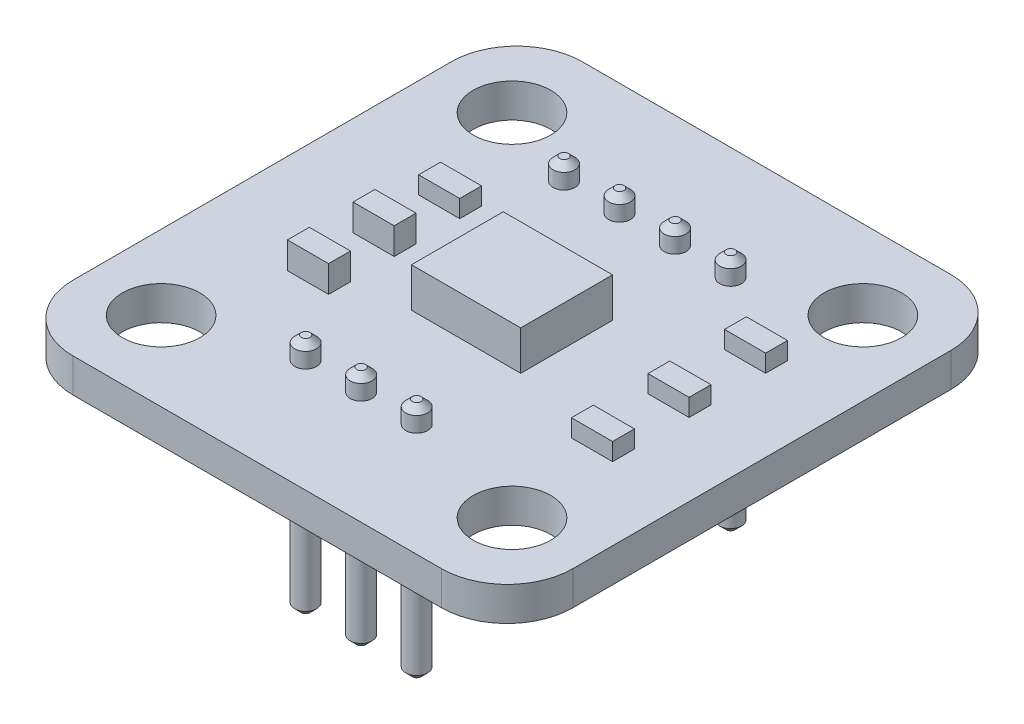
ISO-10303-21;
HEADER;
FILE_DESCRIPTION(('STEP AP214'),'2;1');
FILE_NAME('part.step','',(''),(''),'','','');
FILE_SCHEMA(('AUTOMOTIVE_DESIGN { 1 0 10303 214 1 1 1 1 }'));
ENDSEC;
DATA;
#1=APPLICATION_CONTEXT('core data for automotive mechanical design processes');
#2=APPLICATION_PROTOCOL_DEFINITION('international standard','automotive_design',2000,#1);
#3=PRODUCT_CONTEXT('',#1,'mechanical');
#4=PRODUCT('Part','Part','',(#3));
#5=PRODUCT_RELATED_PRODUCT_CATEGORY('part','',(#4));
#6=PRODUCT_DEFINITION_FORMATION('','',#4);
#7=PRODUCT_DEFINITION_CONTEXT('part definition',#1,'design');
#8=PRODUCT_DEFINITION('design','',#6,#7);
#9=PRODUCT_DEFINITION_SHAPE('','',#8);
#10=(LENGTH_UNIT() NAMED_UNIT(*) SI_UNIT(.MILLI.,.METRE.));
#11=(NAMED_UNIT(*) PLANE_ANGLE_UNIT() SI_UNIT($,.RADIAN.));
#12=(NAMED_UNIT(*) SI_UNIT($,.STERADIAN.) SOLID_ANGLE_UNIT());
#13=UNCERTAINTY_MEASURE_WITH_UNIT(LENGTH_MEASURE(1.E-05),#10,'distance_accuracy_value','');
#14=(GEOMETRIC_REPRESENTATION_CONTEXT(3) GLOBAL_UNCERTAINTY_ASSIGNED_CONTEXT((#13)) GLOBAL_UNIT_ASSIGNED_CONTEXT((#10,
#11,#12)) REPRESENTATION_CONTEXT('',''));
#15=CARTESIAN_POINT('',(0.,0.,0.));
#16=DIRECTION('',(0.,0.,1.));
#17=DIRECTION('',(1.,0.,0.));
#18=AXIS2_PLACEMENT_3D('',#15,#16,#17);
#19=CARTESIAN_POINT('',(0.,0.,0.));
#20=DIRECTION('',(0.,1.,0.));
#21=DIRECTION('',(1.,0.,0.));
#22=AXIS2_PLACEMENT_3D('',#19,#20,#21);
#23=PLANE('',#22);
#24=CARTESIAN_POINT('',(-2.94,0.,6.5));
#25=DIRECTION('',(0.,-1.,0.));
#26=DIRECTION('',(1.,0.,0.));
#27=AXIS2_PLACEMENT_3D('',#24,#25,#26);
#28=CIRCLE('',#27,0.5);
#29=CARTESIAN_POINT('',(-3.44,0.,6.5));
#30=VERTEX_POINT('',#29);
#31=EDGE_CURVE('E900',#30,#30,#28,.T.);
#32=ORIENTED_EDGE('',*,*,#31,.T.);
#33=EDGE_LOOP('',(#32));
#34=FACE_BOUND('',#33,.T.);
#35=CARTESIAN_POINT('',(-4.12,0.,-6.5));
#36=DIRECTION('',(0.,-1.,0.));
#37=DIRECTION('',(1.,0.,0.));
#38=AXIS2_PLACEMENT_3D('',#35,#36,#37);
#39=CIRCLE('',#38,0.5);
#40=CARTESIAN_POINT('',(-4.62,0.,-6.5));
#41=VERTEX_POINT('',#40);
#42=EDGE_CURVE('E719',#41,#41,#39,.T.);
#43=ORIENTED_EDGE('',*,*,#42,.T.);
#44=EDGE_LOOP('',(#43));
#45=FACE_BOUND('',#44,.T.);
#46=CARTESIAN_POINT('',(3.5,0.,-6.5));
#47=DIRECTION('',(0.,-1.,0.));
#48=DIRECTION('',(1.,0.,0.));
#49=AXIS2_PLACEMENT_3D('',#46,#47,#48);
#50=CIRCLE('',#49,0.5);
#51=CARTESIAN_POINT('',(3.,0.,-6.5));
#52=VERTEX_POINT('',#51);
#53=EDGE_CURVE('E1190',#52,#52,#50,.T.);
#54=ORIENTED_EDGE('',*,*,#53,.T.);
#55=EDGE_LOOP('',(#54));
#56=FACE_BOUND('',#55,.T.);
#57=CARTESIAN_POINT('',(0.96,0.,-6.5));
#58=DIRECTION('',(0.,-1.,0.));
#59=DIRECTION('',(1.,0.,0.));
#60=AXIS2_PLACEMENT_3D('',#57,#58,#59);
#61=CIRCLE('',#60,0.5);
#62=CARTESIAN_POINT('',(0.46,0.,-6.5));
#63=VERTEX_POINT('',#62);
#64=EDGE_CURVE('E996',#63,#63,#61,.T.);
#65=ORIENTED_EDGE('',*,*,#64,.T.);
#66=EDGE_LOOP('',(#65));
#67=FACE_BOUND('',#66,.T.);
#68=CARTESIAN_POINT('',(-1.58,0.,-6.5));
#69=DIRECTION('',(0.,-1.,0.));
#70=DIRECTION('',(1.,0.,0.));
#71=AXIS2_PLACEMENT_3D('',#68,#69,#70);
#72=CIRCLE('',#71,0.5);
#73=CARTESIAN_POINT('',(-2.08,0.,-6.5));
#74=VERTEX_POINT('',#73);
#75=EDGE_CURVE('E1021',#74,#74,#72,.T.);
#76=ORIENTED_EDGE('',*,*,#75,.T.);
#77=EDGE_LOOP('',(#76));
#78=FACE_BOUND('',#77,.T.);
#79=CARTESIAN_POINT('',(-0.4,0.,6.5));
#80=DIRECTION('',(0.,-1.,0.));
#81=DIRECTION('',(1.,0.,0.));
#82=AXIS2_PLACEMENT_3D('',#79,#80,#81);
#83=CIRCLE('',#82,0.5);
#84=CARTESIAN_POINT('',(-0.9,0.,6.5));
#85=VERTEX_POINT('',#84);
#86=EDGE_CURVE('E860',#85,#85,#83,.T.);
#87=ORIENTED_EDGE('',*,*,#86,.T.);
#88=EDGE_LOOP('',(#87));
#89=FACE_BOUND('',#88,.T.);
#90=CARTESIAN_POINT('',(2.14,0.,6.5));
#91=DIRECTION('',(0.,-1.,0.));
#92=DIRECTION('',(1.,0.,0.));
#93=AXIS2_PLACEMENT_3D('',#90,#91,#92);
#94=CIRCLE('',#93,0.5);
#95=CARTESIAN_POINT('',(1.64,0.,6.5));
#96=VERTEX_POINT('',#95);
#97=EDGE_CURVE('E841',#96,#96,#94,.T.);
#98=ORIENTED_EDGE('',*,*,#97,.T.);
#99=EDGE_LOOP('',(#98));
#100=FACE_BOUND('',#99,.T.);
#101=DIRECTION('',(1.,0.,0.));
#102=VECTOR('',#101,1.);
#103=CARTESIAN_POINT('',(1.25,0.,-2.1));
#104=LINE('',#103,#102);
#105=CARTESIAN_POINT('',(-2.5,0.,-2.1));
#106=VERTEX_POINT('',#105);
#107=CARTESIAN_POINT('',(2.5,0.,-2.1));
#108=VERTEX_POINT('',#107);
#109=EDGE_CURVE('E1205',#106,#108,#104,.T.);
#110=ORIENTED_EDGE('',*,*,#109,.T.);
#111=DIRECTION('',(0.,0.,1.));
#112=VECTOR('',#111,1.);
#113=CARTESIAN_POINT('',(2.5,0.,1.05));
#114=LINE('',#113,#112);
#115=CARTESIAN_POINT('',(2.5,0.,2.1));
#116=VERTEX_POINT('',#115);
#117=EDGE_CURVE('E1130',#108,#116,#114,.T.);
#118=ORIENTED_EDGE('',*,*,#117,.T.);
#119=DIRECTION('',(-1.,0.,0.));
#120=VECTOR('',#119,1.);
#121=CARTESIAN_POINT('',(-1.25,0.,2.1));
#122=LINE('',#121,#120);
#123=CARTESIAN_POINT('',(-2.5,0.,2.1));
#124=VERTEX_POINT('',#123);
#125=EDGE_CURVE('E882',#116,#124,#122,.T.);
#126=ORIENTED_EDGE('',*,*,#125,.T.);
#127=DIRECTION('',(0.,0.,-1.));
#128=VECTOR('',#127,1.);
#129=CARTESIAN_POINT('',(-2.5,0.,-1.05));
#130=LINE('',#129,#128);
#131=EDGE_CURVE('E25',#124,#106,#130,.T.);
#132=ORIENTED_EDGE('',*,*,#131,.T.);
#133=EDGE_LOOP('',(#110,#118,#126,#132));
#134=FACE_BOUND('',#133,.T.);
#135=DIRECTION('',(0.,0.,-1.));
#136=VECTOR('',#135,1.);
#137=CARTESIAN_POINT('',(6.22,0.,-0.50000001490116));
#138=LINE('',#137,#136);
#139=CARTESIAN_POINT('',(6.22,0.,-1.49011580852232E-08));
#140=VERTEX_POINT('',#139);
#141=CARTESIAN_POINT('',(6.22,0.,-1.00000002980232));
#142=VERTEX_POINT('',#141);
#143=EDGE_CURVE('E1068',#140,#142,#138,.T.);
#144=ORIENTED_EDGE('',*,*,#143,.T.);
#145=DIRECTION('',(1.,0.,0.));
#146=VECTOR('',#145,1.);
#147=CARTESIAN_POINT('',(4.05,0.,-1.00000002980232));
#148=LINE('',#147,#146);
#149=CARTESIAN_POINT('',(8.1,0.,-1.00000002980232));
#150=VERTEX_POINT('',#149);
#151=EDGE_CURVE('E829',#142,#150,#148,.T.);
#152=ORIENTED_EDGE('',*,*,#151,.T.);
#153=DIRECTION('',(0.,0.,1.));
#154=VECTOR('',#153,1.);
#155=CARTESIAN_POINT('',(8.1,0.,-7.45057904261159E-09));
#156=LINE('',#155,#154);
#157=CARTESIAN_POINT('',(8.1,0.,-1.49011580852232E-08));
#158=VERTEX_POINT('',#157);
#159=EDGE_CURVE('E639',#150,#158,#156,.T.);
#160=ORIENTED_EDGE('',*,*,#159,.T.);
#161=DIRECTION('',(-1.,0.,0.));
#162=VECTOR('',#161,1.);
#163=CARTESIAN_POINT('',(3.11,0.,-1.49011580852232E-08));
#164=LINE('',#163,#162);
#165=EDGE_CURVE('E1070',#158,#140,#164,.T.);
#166=ORIENTED_EDGE('',*,*,#165,.T.);
#167=EDGE_LOOP('',(#144,#152,#160,#166));
#168=FACE_BOUND('',#167,.T.);
#169=DIRECTION('',(0.,0.,-1.));
#170=VECTOR('',#169,1.);
#171=CARTESIAN_POINT('',(6.22,0.,1.24999999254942));
#172=LINE('',#171,#170);
#173=CARTESIAN_POINT('',(6.22,0.,3.5));
#174=VERTEX_POINT('',#173);
#175=CARTESIAN_POINT('',(6.22,0.,2.49999998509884));
#176=VERTEX_POINT('',#175);
#177=EDGE_CURVE('E937',#174,#176,#172,.T.);
#178=ORIENTED_EDGE('',*,*,#177,.T.);
#179=DIRECTION('',(1.,0.,0.));
#180=VECTOR('',#179,1.);
#181=CARTESIAN_POINT('',(4.05,0.,2.49999998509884));
#182=LINE('',#181,#180);
#183=CARTESIAN_POINT('',(8.1,0.,2.49999998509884));
#184=VERTEX_POINT('',#183);
#185=EDGE_CURVE('E1309',#176,#184,#182,.T.);
#186=ORIENTED_EDGE('',*,*,#185,.T.);
#187=DIRECTION('',(0.,0.,1.));
#188=VECTOR('',#187,1.);
#189=CARTESIAN_POINT('',(8.1,0.,1.75));
#190=LINE('',#189,#188);
#191=CARTESIAN_POINT('',(8.1,0.,3.5));
#192=VERTEX_POINT('',#191);
#193=EDGE_CURVE('E1043',#184,#192,#190,.T.);
#194=ORIENTED_EDGE('',*,*,#193,.T.);
#195=DIRECTION('',(-1.,0.,0.));
#196=VECTOR('',#195,1.);
#197=CARTESIAN_POINT('',(3.11,0.,3.5));
#198=LINE('',#197,#196);
#199=EDGE_CURVE('E1069',#192,#174,#198,.T.);
#200=ORIENTED_EDGE('',*,*,#199,.T.);
#201=EDGE_LOOP('',(#178,#186,#194,#200));
#202=FACE_BOUND('',#201,.T.);
#203=DIRECTION('',(0.,0.,-1.));
#204=VECTOR('',#203,1.);
#205=CARTESIAN_POINT('',(6.22,0.,-2.25000002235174));
#206=LINE('',#205,#204);
#207=CARTESIAN_POINT('',(6.22,0.,-3.50000002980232));
#208=VERTEX_POINT('',#207);
#209=CARTESIAN_POINT('',(6.22,0.,-4.50000004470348));
#210=VERTEX_POINT('',#209);
#211=EDGE_CURVE('E1035',#208,#210,#206,.T.);
#212=ORIENTED_EDGE('',*,*,#211,.T.);
#213=DIRECTION('',(1.,0.,0.));
#214=VECTOR('',#213,1.);
#215=CARTESIAN_POINT('',(4.05,0.,-4.50000004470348));
#216=LINE('',#215,#214);
#217=CARTESIAN_POINT('',(8.1,0.,-4.50000004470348));
#218=VERTEX_POINT('',#217);
#219=EDGE_CURVE('E903',#210,#218,#216,.T.);
#220=ORIENTED_EDGE('',*,*,#219,.T.);
#221=DIRECTION('',(0.,0.,1.));
#222=VECTOR('',#221,1.);
#223=CARTESIAN_POINT('',(8.1,0.,-1.75000001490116));
#224=LINE('',#223,#222);
#225=CARTESIAN_POINT('',(8.1,0.,-3.50000002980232));
#226=VERTEX_POINT('',#225);
#227=EDGE_CURVE('E768',#218,#226,#224,.T.);
#228=ORIENTED_EDGE('',*,*,#227,.T.);
#229=DIRECTION('',(-1.,0.,0.));
#230=VECTOR('',#229,1.);
#231=CARTESIAN_POINT('',(3.11,0.,-3.50000002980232));
#232=LINE('',#231,#230);
#233=EDGE_CURVE('E656',#226,#208,#232,.T.);
#234=ORIENTED_EDGE('',*,*,#233,.T.);
#235=EDGE_LOOP('',(#212,#220,#228,#234));
#236=FACE_BOUND('',#235,.T.);
#237=DIRECTION('',(0.,0.,-1.));
#238=VECTOR('',#237,1.);
#239=CARTESIAN_POINT('',(-6.9,0.,-1.81500002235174));
#240=LINE('',#239,#238);
#241=CARTESIAN_POINT('',(-6.9,0.,-2.63000002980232));
#242=VERTEX_POINT('',#241);
#243=CARTESIAN_POINT('',(-6.9,0.,-3.63000004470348));
#244=VERTEX_POINT('',#243);
#245=EDGE_CURVE('E890',#242,#244,#240,.T.);
#246=ORIENTED_EDGE('',*,*,#245,.T.);
#247=DIRECTION('',(1.,0.,0.));
#248=VECTOR('',#247,1.);
#249=CARTESIAN_POINT('',(-2.51,0.,-3.63000004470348));
#250=LINE('',#249,#248);
#251=CARTESIAN_POINT('',(-5.02,0.,-3.63000004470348));
#252=VERTEX_POINT('',#251);
#253=EDGE_CURVE('E1031',#244,#252,#250,.T.);
#254=ORIENTED_EDGE('',*,*,#253,.T.);
#255=DIRECTION('',(0.,0.,1.));
#256=VECTOR('',#255,1.);
#257=CARTESIAN_POINT('',(-5.02,0.,-1.31500001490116));
#258=LINE('',#257,#256);
#259=CARTESIAN_POINT('',(-5.02,0.,-2.63000002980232));
#260=VERTEX_POINT('',#259);
#261=EDGE_CURVE('E785',#252,#260,#258,.T.);
#262=ORIENTED_EDGE('',*,*,#261,.T.);
#263=DIRECTION('',(-1.,0.,0.));
#264=VECTOR('',#263,1.);
#265=CARTESIAN_POINT('',(-3.45,0.,-2.63000002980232));
#266=LINE('',#265,#264);
#267=EDGE_CURVE('E798',#260,#242,#266,.T.);
#268=ORIENTED_EDGE('',*,*,#267,.T.);
#269=EDGE_LOOP('',(#246,#254,#262,#268));
#270=FACE_BOUND('',#269,.T.);
#271=DIRECTION('',(0.,0.,-1.));
#272=VECTOR('',#271,1.);
#273=CARTESIAN_POINT('',(-6.9,0.,1.18499999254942));
#274=LINE('',#273,#272);
#275=CARTESIAN_POINT('',(-6.9,0.,3.37));
#276=VERTEX_POINT('',#275);
#277=CARTESIAN_POINT('',(-6.9,0.,2.36999998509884));
#278=VERTEX_POINT('',#277);
#279=EDGE_CURVE('E691',#276,#278,#274,.T.);
#280=ORIENTED_EDGE('',*,*,#279,.T.);
#281=DIRECTION('',(1.,0.,0.));
#282=VECTOR('',#281,1.);
#283=CARTESIAN_POINT('',(-2.51,0.,2.36999998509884));
#284=LINE('',#283,#282);
#285=CARTESIAN_POINT('',(-5.02,0.,2.36999998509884));
#286=VERTEX_POINT('',#285);
#287=EDGE_CURVE('E668',#278,#286,#284,.T.);
#288=ORIENTED_EDGE('',*,*,#287,.T.);
#289=DIRECTION('',(0.,0.,1.));
#290=VECTOR('',#289,1.);
#291=CARTESIAN_POINT('',(-5.02,0.,1.685));
#292=LINE('',#291,#290);
#293=CARTESIAN_POINT('',(-5.02,0.,3.37));
#294=VERTEX_POINT('',#293);
#295=EDGE_CURVE('E974',#286,#294,#292,.T.);
#296=ORIENTED_EDGE('',*,*,#295,.T.);
#297=DIRECTION('',(-1.,0.,0.));
#298=VECTOR('',#297,1.);
#299=CARTESIAN_POINT('',(-3.45,0.,3.37));
#300=LINE('',#299,#298);
#301=EDGE_CURVE('E813',#294,#276,#300,.T.);
#302=ORIENTED_EDGE('',*,*,#301,.T.);
#303=EDGE_LOOP('',(#280,#288,#296,#302));
#304=FACE_BOUND('',#303,.T.);
#305=DIRECTION('',(0.,0.,-1.));
#306=VECTOR('',#305,1.);
#307=CARTESIAN_POINT('',(-6.9,0.,-0.31500001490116));
#308=LINE('',#307,#306);
#309=CARTESIAN_POINT('',(-6.9,0.,0.369999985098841));
#310=VERTEX_POINT('',#309);
#311=CARTESIAN_POINT('',(-6.9,0.,-0.63000002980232));
#312=VERTEX_POINT('',#311);
#313=EDGE_CURVE('E1150',#310,#312,#308,.T.);
#314=ORIENTED_EDGE('',*,*,#313,.T.);
#315=DIRECTION('',(1.,0.,0.));
#316=VECTOR('',#315,1.);
#317=CARTESIAN_POINT('',(-2.51,0.,-0.63000002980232));
#318=LINE('',#317,#316);
#319=CARTESIAN_POINT('',(-5.02,0.,-0.63000002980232));
#320=VERTEX_POINT('',#319);
#321=EDGE_CURVE('E720',#312,#320,#318,.T.);
#322=ORIENTED_EDGE('',*,*,#321,.T.);
#323=DIRECTION('',(0.,0.,1.));
#324=VECTOR('',#323,1.);
#325=CARTESIAN_POINT('',(-5.02,0.,0.18499999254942));
#326=LINE('',#325,#324);
#327=CARTESIAN_POINT('',(-5.02,0.,0.369999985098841));
#328=VERTEX_POINT('',#327);
#329=EDGE_CURVE('E778',#320,#328,#326,.T.);
#330=ORIENTED_EDGE('',*,*,#329,.T.);
#331=DIRECTION('',(-1.,0.,0.));
#332=VECTOR('',#331,1.);
#333=CARTESIAN_POINT('',(-3.45,0.,0.369999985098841));
#334=LINE('',#333,#332);
#335=EDGE_CURVE('E692',#328,#310,#334,.T.);
#336=ORIENTED_EDGE('',*,*,#335,.T.);
#337=EDGE_LOOP('',(#314,#322,#330,#336));
#338=FACE_BOUND('',#337,.T.);
#339=CARTESIAN_POINT('',(8.025,0.,8.025));
#340=DIRECTION('',(0.,-1.,0.));
#341=DIRECTION('',(1.,0.,0.));
#342=AXIS2_PLACEMENT_3D('',#339,#340,#341);
#343=CIRCLE('',#342,1.775);
#344=CARTESIAN_POINT('',(6.25,0.,8.025));
#345=VERTEX_POINT('',#344);
#346=EDGE_CURVE('E1038',#345,#345,#343,.T.);
#347=ORIENTED_EDGE('',*,*,#346,.T.);
#348=EDGE_LOOP('',(#347));
#349=FACE_BOUND('',#348,.T.);
#350=CARTESIAN_POINT('',(-8.025,0.,-8.025));
#351=DIRECTION('',(0.,-1.,0.));
#352=DIRECTION('',(1.,0.,0.));
#353=AXIS2_PLACEMENT_3D('',#350,#351,#352);
#354=CIRCLE('',#353,1.775);
#355=CARTESIAN_POINT('',(-9.8,0.,-8.025));
#356=VERTEX_POINT('',#355);
#357=EDGE_CURVE('E677',#356,#356,#354,.T.);
#358=ORIENTED_EDGE('',*,*,#357,.T.);
#359=EDGE_LOOP('',(#358));
#360=FACE_BOUND('',#359,.T.);
#361=CARTESIAN_POINT('',(-8.025,0.,8.025));
#362=DIRECTION('',(0.,-1.,0.));
#363=DIRECTION('',(1.,0.,0.));
#364=AXIS2_PLACEMENT_3D('',#361,#362,#363);
#365=CIRCLE('',#364,1.775);
#366=CARTESIAN_POINT('',(-9.8,0.,8.025));
#367=VERTEX_POINT('',#366);
#368=EDGE_CURVE('E678',#367,#367,#365,.T.);
#369=ORIENTED_EDGE('',*,*,#368,.T.);
#370=EDGE_LOOP('',(#369));
#371=FACE_BOUND('',#370,.T.);
#372=CARTESIAN_POINT('',(8.025,0.,-8.025));
#373=DIRECTION('',(0.,-1.,0.));
#374=DIRECTION('',(1.,0.,0.));
#375=AXIS2_PLACEMENT_3D('',#372,#373,#374);
#376=CIRCLE('',#375,1.775);
#377=CARTESIAN_POINT('',(6.25,0.,-8.025));
#378=VERTEX_POINT('',#377);
#379=EDGE_CURVE('E876',#378,#378,#376,.T.);
#380=ORIENTED_EDGE('',*,*,#379,.T.);
#381=EDGE_LOOP('',(#380));
#382=FACE_BOUND('',#381,.T.);
#383=CARTESIAN_POINT('',(8.43,0.,-8.65));
#384=DIRECTION('',(0.,1.,0.));
#385=DIRECTION('',(1.,0.,0.));
#386=AXIS2_PLACEMENT_3D('',#383,#384,#385);
#387=CIRCLE('',#386,3.);
#388=CARTESIAN_POINT('',(11.43,0.,-8.65));
#389=VERTEX_POINT('',#388);
#390=CARTESIAN_POINT('',(8.43,0.,-11.65));
#391=VERTEX_POINT('',#390);
#392=EDGE_CURVE('E758',#389,#391,#387,.T.);
#393=ORIENTED_EDGE('',*,*,#392,.T.);
#394=DIRECTION('',(-1.,0.,0.));
#395=VECTOR('',#394,1.);
#396=CARTESIAN_POINT('',(8.43,0.,-11.65));
#397=LINE('',#396,#395);
#398=CARTESIAN_POINT('',(-8.43,0.,-11.65));
#399=VERTEX_POINT('',#398);
#400=EDGE_CURVE('E916',#391,#399,#397,.T.);
#401=ORIENTED_EDGE('',*,*,#400,.T.);
#402=CARTESIAN_POINT('',(-8.43,0.,-8.65));
#403=DIRECTION('',(0.,1.,0.));
#404=DIRECTION('',(0.,0.,1.));
#405=AXIS2_PLACEMENT_3D('',#402,#403,#404);
#406=CIRCLE('',#405,3.);
#407=CARTESIAN_POINT('',(-11.43,0.,-8.65));
#408=VERTEX_POINT('',#407);
#409=EDGE_CURVE('E1147',#399,#408,#406,.T.);
#410=ORIENTED_EDGE('',*,*,#409,.T.);
#411=DIRECTION('',(0.,0.,1.));
#412=VECTOR('',#411,1.);
#413=CARTESIAN_POINT('',(-11.43,0.,-4.325));
#414=LINE('',#413,#412);
#415=CARTESIAN_POINT('',(-11.43,0.,8.65));
#416=VERTEX_POINT('',#415);
#417=EDGE_CURVE('E761',#408,#416,#414,.T.);
#418=ORIENTED_EDGE('',*,*,#417,.T.);
#419=CARTESIAN_POINT('',(-8.43,0.,8.65));
#420=DIRECTION('',(0.,1.,0.));
#421=DIRECTION('',(-1.,0.,0.));
#422=AXIS2_PLACEMENT_3D('',#419,#420,#421);
#423=CIRCLE('',#422,3.);
#424=CARTESIAN_POINT('',(-8.43,0.,11.65));
#425=VERTEX_POINT('',#424);
#426=EDGE_CURVE('E667',#416,#425,#423,.T.);
#427=ORIENTED_EDGE('',*,*,#426,.T.);
#428=DIRECTION('',(1.,0.,0.));
#429=VECTOR('',#428,1.);
#430=CARTESIAN_POINT('',(-8.43,0.,11.65));
#431=LINE('',#430,#429);
#432=CARTESIAN_POINT('',(8.43,0.,11.65));
#433=VERTEX_POINT('',#432);
#434=EDGE_CURVE('E1260',#425,#433,#431,.T.);
#435=ORIENTED_EDGE('',*,*,#434,.T.);
#436=CARTESIAN_POINT('',(8.43,0.,8.65));
#437=DIRECTION('',(0.,1.,0.));
#438=DIRECTION('',(0.,0.,1.));
#439=AXIS2_PLACEMENT_3D('',#436,#437,#438);
#440=CIRCLE('',#439,3.);
#441=CARTESIAN_POINT('',(11.43,0.,8.65));
#442=VERTEX_POINT('',#441);
#443=EDGE_CURVE('E987',#433,#442,#440,.T.);
#444=ORIENTED_EDGE('',*,*,#443,.T.);
#445=DIRECTION('',(0.,0.,-1.));
#446=VECTOR('',#445,1.);
#447=CARTESIAN_POINT('',(11.43,0.,4.325));
#448=LINE('',#447,#446);
#449=EDGE_CURVE('E872',#442,#389,#448,.T.);
#450=ORIENTED_EDGE('',*,*,#449,.T.);
#451=EDGE_LOOP('',(#393,#401,#410,#418,#427,#435,#444,#450));
#452=FACE_BOUND('',#451,.T.);
#453=ADVANCED_FACE('F14',(#34,#45,#56,#67,#78,#89,#100,#134,#168,#202,#236,#270,#304,#338,#349,
#360,#371,#382,#452),#23,.T.);
#454=CARTESIAN_POINT('',(0.,1.8,0.));
#455=DIRECTION('',(0.,1.,0.));
#456=DIRECTION('',(1.,0.,0.));
#457=AXIS2_PLACEMENT_3D('',#454,#455,#456);
#458=PLANE('',#457);
#459=DIRECTION('',(0.,0.,1.));
#460=VECTOR('',#459,1.);
#461=CARTESIAN_POINT('',(-2.5,1.8,-2.1));
#462=LINE('',#461,#460);
#463=CARTESIAN_POINT('',(-2.5,1.8,-2.1));
#464=VERTEX_POINT('',#463);
#465=CARTESIAN_POINT('',(-2.5,1.8,2.1));
#466=VERTEX_POINT('',#465);
#467=EDGE_CURVE('E9',#464,#466,#462,.T.);
#468=ORIENTED_EDGE('',*,*,#467,.T.);
#469=DIRECTION('',(1.,0.,0.));
#470=VECTOR('',#469,1.);
#471=CARTESIAN_POINT('',(-2.5,1.8,2.1));
#472=LINE('',#471,#470);
#473=CARTESIAN_POINT('',(2.5,1.8,2.1));
#474=VERTEX_POINT('',#473);
#475=EDGE_CURVE('E948',#466,#474,#472,.T.);
#476=ORIENTED_EDGE('',*,*,#475,.T.);
#477=DIRECTION('',(0.,0.,-1.));
#478=VECTOR('',#477,1.);
#479=CARTESIAN_POINT('',(2.5,1.8,2.1));
#480=LINE('',#479,#478);
#481=CARTESIAN_POINT('',(2.5,1.8,-2.1));
#482=VERTEX_POINT('',#481);
#483=EDGE_CURVE('E883',#474,#482,#480,.T.);
#484=ORIENTED_EDGE('',*,*,#483,.T.);
#485=DIRECTION('',(-1.,0.,0.));
#486=VECTOR('',#485,1.);
#487=CARTESIAN_POINT('',(2.5,1.8,-2.1));
#488=LINE('',#487,#486);
#489=EDGE_CURVE('E703',#482,#464,#488,.T.);
#490=ORIENTED_EDGE('',*,*,#489,.T.);
#491=EDGE_LOOP('',(#468,#476,#484,#490));
#492=FACE_BOUND('',#491,.T.);
#493=ADVANCED_FACE('F1548',(#492),#458,.T.);
#494=CARTESIAN_POINT('',(-2.5,0.,-2.1));
#495=DIRECTION('',(-1.,0.,0.));
#496=DIRECTION('',(0.,0.,1.));
#497=AXIS2_PLACEMENT_3D('',#494,#495,#496);
#498=PLANE('',#497);
#499=ORIENTED_EDGE('',*,*,#131,.F.);
#500=DIRECTION('',(0.,1.,0.));
#501=VECTOR('',#500,1.);
#502=CARTESIAN_POINT('',(-2.5,0.,2.1));
#503=LINE('',#502,#501);
#504=EDGE_CURVE('E945',#124,#466,#503,.T.);
#505=ORIENTED_EDGE('',*,*,#504,.T.);
#506=ORIENTED_EDGE('',*,*,#467,.F.);
#507=DIRECTION('',(0.,1.,0.));
#508=VECTOR('',#507,1.);
#509=CARTESIAN_POINT('',(-2.5,0.,-2.1));
#510=LINE('',#509,#508);
#511=EDGE_CURVE('E707',#106,#464,#510,.T.);
#512=ORIENTED_EDGE('',*,*,#511,.F.);
#513=EDGE_LOOP('',(#499,#505,#506,#512));
#514=FACE_BOUND('',#513,.T.);
#515=ADVANCED_FACE('F1554',(#514),#498,.T.);
#516=CARTESIAN_POINT('',(-2.5,0.,2.1));
#517=DIRECTION('',(0.,0.,1.));
#518=DIRECTION('',(1.,0.,0.));
#519=AXIS2_PLACEMENT_3D('',#516,#517,#518);
#520=PLANE('',#519);
#521=ORIENTED_EDGE('',*,*,#125,.F.);
#522=DIRECTION('',(0.,1.,0.));
#523=VECTOR('',#522,1.);
#524=CARTESIAN_POINT('',(2.5,0.,2.1));
#525=LINE('',#524,#523);
#526=EDGE_CURVE('E878',#116,#474,#525,.T.);
#527=ORIENTED_EDGE('',*,*,#526,.T.);
#528=ORIENTED_EDGE('',*,*,#475,.F.);
#529=ORIENTED_EDGE('',*,*,#504,.F.);
#530=EDGE_LOOP('',(#521,#527,#528,#529));
#531=FACE_BOUND('',#530,.T.);
#532=ADVANCED_FACE('F1563',(#531),#520,.T.);
#533=CARTESIAN_POINT('',(2.5,0.,2.1));
#534=DIRECTION('',(1.,0.,0.));
#535=DIRECTION('',(0.,1.,0.));
#536=AXIS2_PLACEMENT_3D('',#533,#534,#535);
#537=PLANE('',#536);
#538=ORIENTED_EDGE('',*,*,#117,.F.);
#539=DIRECTION('',(0.,1.,0.));
#540=VECTOR('',#539,1.);
#541=CARTESIAN_POINT('',(2.5,0.,-2.1));
#542=LINE('',#541,#540);
#543=EDGE_CURVE('E706',#108,#482,#542,.T.);
#544=ORIENTED_EDGE('',*,*,#543,.T.);
#545=ORIENTED_EDGE('',*,*,#483,.F.);
#546=ORIENTED_EDGE('',*,*,#526,.F.);
#547=EDGE_LOOP('',(#538,#544,#545,#546));
#548=FACE_BOUND('',#547,.T.);
#549=ADVANCED_FACE('F1817',(#548),#537,.T.);
#550=CARTESIAN_POINT('',(2.5,0.,-2.1));
#551=DIRECTION('',(0.,0.,-1.));
#552=DIRECTION('',(0.,-1.,0.));
#553=AXIS2_PLACEMENT_3D('',#550,#551,#552);
#554=PLANE('',#553);
#555=ORIENTED_EDGE('',*,*,#109,.F.);
#556=ORIENTED_EDGE('',*,*,#511,.T.);
#557=ORIENTED_EDGE('',*,*,#489,.F.);
#558=ORIENTED_EDGE('',*,*,#543,.F.);
#559=EDGE_LOOP('',(#555,#556,#557,#558));
#560=FACE_BOUND('',#559,.T.);
#561=ADVANCED_FACE('F1828',(#560),#554,.T.);
#562=CARTESIAN_POINT('',(7.16,0.8,-0.500000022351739));
#563=DIRECTION('',(0.,1.,0.));
#564=DIRECTION('',(1.,0.,0.));
#565=AXIS2_PLACEMENT_3D('',#562,#563,#564);
#566=PLANE('',#565);
#567=DIRECTION('',(1.,0.,0.));
#568=VECTOR('',#567,1.);
#569=CARTESIAN_POINT('',(8.1,0.8,-1.49011580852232E-08));
#570=LINE('',#569,#568);
#571=CARTESIAN_POINT('',(6.22,0.8,-1.49011580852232E-08));
#572=VERTEX_POINT('',#571);
#573=CARTESIAN_POINT('',(8.1,0.8,-1.49011580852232E-08));
#574=VERTEX_POINT('',#573);
#575=EDGE_CURVE('E1073',#572,#574,#570,.T.);
#576=ORIENTED_EDGE('',*,*,#575,.T.);
#577=DIRECTION('',(0.,0.,-1.));
#578=VECTOR('',#577,1.);
#579=CARTESIAN_POINT('',(8.1,0.8,-1.00000002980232));
#580=LINE('',#579,#578);
#581=CARTESIAN_POINT('',(8.1,0.8,-1.00000002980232));
#582=VERTEX_POINT('',#581);
#583=EDGE_CURVE('E643',#574,#582,#580,.T.);
#584=ORIENTED_EDGE('',*,*,#583,.T.);
#585=DIRECTION('',(-1.,0.,0.));
#586=VECTOR('',#585,1.);
#587=CARTESIAN_POINT('',(6.22,0.8,-1.00000002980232));
#588=LINE('',#587,#586);
#589=CARTESIAN_POINT('',(6.22,0.8,-1.00000002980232));
#590=VERTEX_POINT('',#589);
#591=EDGE_CURVE('E833',#582,#590,#588,.T.);
#592=ORIENTED_EDGE('',*,*,#591,.T.);
#593=DIRECTION('',(0.,0.,1.));
#594=VECTOR('',#593,1.);
#595=CARTESIAN_POINT('',(6.22,0.8,-1.49011580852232E-08));
#596=LINE('',#595,#594);
#597=EDGE_CURVE('E1127',#590,#572,#596,.T.);
#598=ORIENTED_EDGE('',*,*,#597,.T.);
#599=EDGE_LOOP('',(#576,#584,#592,#598));
#600=FACE_BOUND('',#599,.T.);
#601=ADVANCED_FACE('F1838',(#600),#566,.T.);
#602=CARTESIAN_POINT('',(6.22,0.,-1.49011580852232E-08));
#603=DIRECTION('',(0.,0.,1.));
#604=DIRECTION('',(1.,0.,0.));
#605=AXIS2_PLACEMENT_3D('',#602,#603,#604);
#606=PLANE('',#605);
#607=ORIENTED_EDGE('',*,*,#165,.F.);
#608=DIRECTION('',(0.,1.,0.));
#609=VECTOR('',#608,1.);
#610=CARTESIAN_POINT('',(8.1,0.,-1.49011580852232E-08));
#611=LINE('',#610,#609);
#612=EDGE_CURVE('E1074',#158,#574,#611,.T.);
#613=ORIENTED_EDGE('',*,*,#612,.T.);
#614=ORIENTED_EDGE('',*,*,#575,.F.);
#615=DIRECTION('',(0.,1.,0.));
#616=VECTOR('',#615,1.);
#617=CARTESIAN_POINT('',(6.22,0.,-1.49011580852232E-08));
#618=LINE('',#617,#616);
#619=EDGE_CURVE('E1123',#140,#572,#618,.T.);
#620=ORIENTED_EDGE('',*,*,#619,.F.);
#621=EDGE_LOOP('',(#607,#613,#614,#620));
#622=FACE_BOUND('',#621,.T.);
#623=ADVANCED_FACE('F1596',(#622),#606,.T.);
#624=CARTESIAN_POINT('',(8.1,0.,-1.49011580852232E-08));
#625=DIRECTION('',(1.,0.,0.));
#626=DIRECTION('',(0.,1.,0.));
#627=AXIS2_PLACEMENT_3D('',#624,#625,#626);
#628=PLANE('',#627);
#629=ORIENTED_EDGE('',*,*,#159,.F.);
#630=DIRECTION('',(0.,1.,0.));
#631=VECTOR('',#630,1.);
#632=CARTESIAN_POINT('',(8.1,0.,-1.00000002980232));
#633=LINE('',#632,#631);
#634=EDGE_CURVE('E644',#150,#582,#633,.T.);
#635=ORIENTED_EDGE('',*,*,#634,.T.);
#636=ORIENTED_EDGE('',*,*,#583,.F.);
#637=ORIENTED_EDGE('',*,*,#612,.F.);
#638=EDGE_LOOP('',(#629,#635,#636,#637));
#639=FACE_BOUND('',#638,.T.);
#640=ADVANCED_FACE('F1592',(#639),#628,.T.);
#641=CARTESIAN_POINT('',(8.1,0.,-1.00000002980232));
#642=DIRECTION('',(0.,0.,-1.));
#643=DIRECTION('',(-1.,0.,0.));
#644=AXIS2_PLACEMENT_3D('',#641,#642,#643);
#645=PLANE('',#644);
#646=ORIENTED_EDGE('',*,*,#151,.F.);
#647=DIRECTION('',(0.,1.,0.));
#648=VECTOR('',#647,1.);
#649=CARTESIAN_POINT('',(6.22,0.,-1.00000002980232));
#650=LINE('',#649,#648);
#651=EDGE_CURVE('E834',#142,#590,#650,.T.);
#652=ORIENTED_EDGE('',*,*,#651,.T.);
#653=ORIENTED_EDGE('',*,*,#591,.F.);
#654=ORIENTED_EDGE('',*,*,#634,.F.);
#655=EDGE_LOOP('',(#646,#652,#653,#654));
#656=FACE_BOUND('',#655,.T.);
#657=ADVANCED_FACE('F1595',(#656),#645,.T.);
#658=CARTESIAN_POINT('',(6.22,0.,-1.00000002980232));
#659=DIRECTION('',(-1.,0.,0.));
#660=DIRECTION('',(0.,0.,1.));
#661=AXIS2_PLACEMENT_3D('',#658,#659,#660);
#662=PLANE('',#661);
#663=ORIENTED_EDGE('',*,*,#143,.F.);
#664=ORIENTED_EDGE('',*,*,#619,.T.);
#665=ORIENTED_EDGE('',*,*,#597,.F.);
#666=ORIENTED_EDGE('',*,*,#651,.F.);
#667=EDGE_LOOP('',(#663,#664,#665,#666));
#668=FACE_BOUND('',#667,.T.);
#669=ADVANCED_FACE('F1715',(#668),#662,.T.);
#670=CARTESIAN_POINT('',(7.16,0.8,2.99999999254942));
#671=DIRECTION('',(0.,1.,0.));
#672=DIRECTION('',(1.,0.,0.));
#673=AXIS2_PLACEMENT_3D('',#670,#671,#672);
#674=PLANE('',#673);
#675=DIRECTION('',(1.,0.,0.));
#676=VECTOR('',#675,1.);
#677=CARTESIAN_POINT('',(8.1,0.8,3.5));
#678=LINE('',#677,#676);
#679=CARTESIAN_POINT('',(6.22,0.8,3.5));
#680=VERTEX_POINT('',#679);
#681=CARTESIAN_POINT('',(8.1,0.8,3.5));
#682=VERTEX_POINT('',#681);
#683=EDGE_CURVE('E1065',#680,#682,#678,.T.);
#684=ORIENTED_EDGE('',*,*,#683,.T.);
#685=DIRECTION('',(0.,0.,-1.));
#686=VECTOR('',#685,1.);
#687=CARTESIAN_POINT('',(8.1,0.8,2.49999998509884));
#688=LINE('',#687,#686);
#689=CARTESIAN_POINT('',(8.1,0.8,2.49999998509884));
#690=VERTEX_POINT('',#689);
#691=EDGE_CURVE('E1039',#682,#690,#688,.T.);
#692=ORIENTED_EDGE('',*,*,#691,.T.);
#693=DIRECTION('',(-1.,0.,0.));
#694=VECTOR('',#693,1.);
#695=CARTESIAN_POINT('',(6.22,0.8,2.49999998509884));
#696=LINE('',#695,#694);
#697=CARTESIAN_POINT('',(6.22,0.8,2.49999998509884));
#698=VERTEX_POINT('',#697);
#699=EDGE_CURVE('E1202',#690,#698,#696,.T.);
#700=ORIENTED_EDGE('',*,*,#699,.T.);
#701=DIRECTION('',(0.,0.,1.));
#702=VECTOR('',#701,1.);
#703=CARTESIAN_POINT('',(6.22,0.8,3.5));
#704=LINE('',#703,#702);
#705=EDGE_CURVE('E1051',#698,#680,#704,.T.);
#706=ORIENTED_EDGE('',*,*,#705,.T.);
#707=EDGE_LOOP('',(#684,#692,#700,#706));
#708=FACE_BOUND('',#707,.T.);
#709=ADVANCED_FACE('F1718',(#708),#674,.T.);
#710=CARTESIAN_POINT('',(6.22,0.,3.5));
#711=DIRECTION('',(0.,0.,1.));
#712=DIRECTION('',(1.,0.,0.));
#713=AXIS2_PLACEMENT_3D('',#710,#711,#712);
#714=PLANE('',#713);
#715=ORIENTED_EDGE('',*,*,#199,.F.);
#716=DIRECTION('',(0.,1.,0.));
#717=VECTOR('',#716,1.);
#718=CARTESIAN_POINT('',(8.1,0.,3.5));
#719=LINE('',#718,#717);
#720=EDGE_CURVE('E1042',#192,#682,#719,.T.);
#721=ORIENTED_EDGE('',*,*,#720,.T.);
#722=ORIENTED_EDGE('',*,*,#683,.F.);
#723=DIRECTION('',(0.,1.,0.));
#724=VECTOR('',#723,1.);
#725=CARTESIAN_POINT('',(6.22,0.,3.5));
#726=LINE('',#725,#724);
#727=EDGE_CURVE('E941',#174,#680,#726,.T.);
#728=ORIENTED_EDGE('',*,*,#727,.F.);
#729=EDGE_LOOP('',(#715,#721,#722,#728));
#730=FACE_BOUND('',#729,.T.);
#731=ADVANCED_FACE('F1714',(#730),#714,.T.);
#732=CARTESIAN_POINT('',(8.1,0.,3.5));
#733=DIRECTION('',(1.,0.,0.));
#734=DIRECTION('',(0.,1.,0.));
#735=AXIS2_PLACEMENT_3D('',#732,#733,#734);
#736=PLANE('',#735);
#737=ORIENTED_EDGE('',*,*,#193,.F.);
#738=DIRECTION('',(0.,1.,0.));
#739=VECTOR('',#738,1.);
#740=CARTESIAN_POINT('',(8.1,0.,2.49999998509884));
#741=LINE('',#740,#739);
#742=EDGE_CURVE('E1194',#184,#690,#741,.T.);
#743=ORIENTED_EDGE('',*,*,#742,.T.);
#744=ORIENTED_EDGE('',*,*,#691,.F.);
#745=ORIENTED_EDGE('',*,*,#720,.F.);
#746=EDGE_LOOP('',(#737,#743,#744,#745));
#747=FACE_BOUND('',#746,.T.);
#748=ADVANCED_FACE('F1421',(#747),#736,.T.);
#749=CARTESIAN_POINT('',(8.1,0.,2.49999998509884));
#750=DIRECTION('',(0.,0.,-1.));
#751=DIRECTION('',(0.,-1.,0.));
#752=AXIS2_PLACEMENT_3D('',#749,#750,#751);
#753=PLANE('',#752);
#754=ORIENTED_EDGE('',*,*,#185,.F.);
#755=DIRECTION('',(0.,1.,0.));
#756=VECTOR('',#755,1.);
#757=CARTESIAN_POINT('',(6.22,0.,2.49999998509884));
#758=LINE('',#757,#756);
#759=EDGE_CURVE('E1055',#176,#698,#758,.T.);
#760=ORIENTED_EDGE('',*,*,#759,.T.);
#761=ORIENTED_EDGE('',*,*,#699,.F.);
#762=ORIENTED_EDGE('',*,*,#742,.F.);
#763=EDGE_LOOP('',(#754,#760,#761,#762));
#764=FACE_BOUND('',#763,.T.);
#765=ADVANCED_FACE('F1427',(#764),#753,.T.);
#766=CARTESIAN_POINT('',(6.22,0.,2.49999998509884));
#767=DIRECTION('',(-1.,0.,0.));
#768=DIRECTION('',(0.,0.,1.));
#769=AXIS2_PLACEMENT_3D('',#766,#767,#768);
#770=PLANE('',#769);
#771=ORIENTED_EDGE('',*,*,#177,.F.);
#772=ORIENTED_EDGE('',*,*,#727,.T.);
#773=ORIENTED_EDGE('',*,*,#705,.F.);
#774=ORIENTED_EDGE('',*,*,#759,.F.);
#775=EDGE_LOOP('',(#771,#772,#773,#774));
#776=FACE_BOUND('',#775,.T.);
#777=ADVANCED_FACE('F1920',(#776),#770,.T.);
#778=CARTESIAN_POINT('',(7.16,0.8,-4.0000000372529));
#779=DIRECTION('',(0.,1.,0.));
#780=DIRECTION('',(1.,0.,0.));
#781=AXIS2_PLACEMENT_3D('',#778,#779,#780);
#782=PLANE('',#781);
#783=DIRECTION('',(1.,0.,0.));
#784=VECTOR('',#783,1.);
#785=CARTESIAN_POINT('',(8.1,0.8,-3.50000002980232));
#786=LINE('',#785,#784);
#787=CARTESIAN_POINT('',(6.22,0.8,-3.50000002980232));
#788=VERTEX_POINT('',#787);
#789=CARTESIAN_POINT('',(8.1,0.8,-3.50000002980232));
#790=VERTEX_POINT('',#789);
#791=EDGE_CURVE('E660',#788,#790,#786,.T.);
#792=ORIENTED_EDGE('',*,*,#791,.T.);
#793=DIRECTION('',(0.,0.,-1.));
#794=VECTOR('',#793,1.);
#795=CARTESIAN_POINT('',(8.1,0.8,-4.50000004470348));
#796=LINE('',#795,#794);
#797=CARTESIAN_POINT('',(8.1,0.8,-4.50000004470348));
#798=VERTEX_POINT('',#797);
#799=EDGE_CURVE('E772',#790,#798,#796,.T.);
#800=ORIENTED_EDGE('',*,*,#799,.T.);
#801=DIRECTION('',(-1.,0.,0.));
#802=VECTOR('',#801,1.);
#803=CARTESIAN_POINT('',(6.22,0.8,-4.50000004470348));
#804=LINE('',#803,#802);
#805=CARTESIAN_POINT('',(6.22,0.8,-4.50000004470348));
#806=VERTEX_POINT('',#805);
#807=EDGE_CURVE('E907',#798,#806,#804,.T.);
#808=ORIENTED_EDGE('',*,*,#807,.T.);
#809=DIRECTION('',(0.,0.,1.));
#810=VECTOR('',#809,1.);
#811=CARTESIAN_POINT('',(6.22,0.8,-3.50000002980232));
#812=LINE('',#811,#810);
#813=EDGE_CURVE('E988',#806,#788,#812,.T.);
#814=ORIENTED_EDGE('',*,*,#813,.T.);
#815=EDGE_LOOP('',(#792,#800,#808,#814));
#816=FACE_BOUND('',#815,.T.);
#817=ADVANCED_FACE('F1612',(#816),#782,.T.);
#818=CARTESIAN_POINT('',(6.22,0.,-3.50000002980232));
#819=DIRECTION('',(0.,0.,1.));
#820=DIRECTION('',(1.,0.,0.));
#821=AXIS2_PLACEMENT_3D('',#818,#819,#820);
#822=PLANE('',#821);
#823=ORIENTED_EDGE('',*,*,#233,.F.);
#824=DIRECTION('',(0.,1.,0.));
#825=VECTOR('',#824,1.);
#826=CARTESIAN_POINT('',(8.1,0.,-3.50000002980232));
#827=LINE('',#826,#825);
#828=EDGE_CURVE('E661',#226,#790,#827,.T.);
#829=ORIENTED_EDGE('',*,*,#828,.T.);
#830=ORIENTED_EDGE('',*,*,#791,.F.);
#831=DIRECTION('',(0.,1.,0.));
#832=VECTOR('',#831,1.);
#833=CARTESIAN_POINT('',(6.22,0.,-3.50000002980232));
#834=LINE('',#833,#832);
#835=EDGE_CURVE('E992',#208,#788,#834,.T.);
#836=ORIENTED_EDGE('',*,*,#835,.F.);
#837=EDGE_LOOP('',(#823,#829,#830,#836));
#838=FACE_BOUND('',#837,.T.);
#839=ADVANCED_FACE('F1609',(#838),#822,.T.);
#840=CARTESIAN_POINT('',(8.1,0.,-3.50000002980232));
#841=DIRECTION('',(1.,0.,0.));
#842=DIRECTION('',(0.,1.,0.));
#843=AXIS2_PLACEMENT_3D('',#840,#841,#842);
#844=PLANE('',#843);
#845=ORIENTED_EDGE('',*,*,#227,.F.);
#846=DIRECTION('',(0.,1.,0.));
#847=VECTOR('',#846,1.);
#848=CARTESIAN_POINT('',(8.1,0.,-4.50000004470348));
#849=LINE('',#848,#847);
#850=EDGE_CURVE('E773',#218,#798,#849,.T.);
#851=ORIENTED_EDGE('',*,*,#850,.T.);
#852=ORIENTED_EDGE('',*,*,#799,.F.);
#853=ORIENTED_EDGE('',*,*,#828,.F.);
#854=EDGE_LOOP('',(#845,#851,#852,#853));
#855=FACE_BOUND('',#854,.T.);
#856=ADVANCED_FACE('F1611',(#855),#844,.T.);
#857=CARTESIAN_POINT('',(8.1,0.,-4.50000004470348));
#858=DIRECTION('',(0.,0.,-1.));
#859=DIRECTION('',(0.,-1.,0.));
#860=AXIS2_PLACEMENT_3D('',#857,#858,#859);
#861=PLANE('',#860);
#862=ORIENTED_EDGE('',*,*,#219,.F.);
#863=DIRECTION('',(0.,1.,0.));
#864=VECTOR('',#863,1.);
#865=CARTESIAN_POINT('',(6.22,0.,-4.50000004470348));
#866=LINE('',#865,#864);
#867=EDGE_CURVE('E908',#210,#806,#866,.T.);
#868=ORIENTED_EDGE('',*,*,#867,.T.);
#869=ORIENTED_EDGE('',*,*,#807,.F.);
#870=ORIENTED_EDGE('',*,*,#850,.F.);
#871=EDGE_LOOP('',(#862,#868,#869,#870));
#872=FACE_BOUND('',#871,.T.);
#873=ADVANCED_FACE('F1619',(#872),#861,.T.);
#874=CARTESIAN_POINT('',(6.22,0.,-4.50000004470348));
#875=DIRECTION('',(-1.,0.,0.));
#876=DIRECTION('',(0.,0.,1.));
#877=AXIS2_PLACEMENT_3D('',#874,#875,#876);
#878=PLANE('',#877);
#879=ORIENTED_EDGE('',*,*,#211,.F.);
#880=ORIENTED_EDGE('',*,*,#835,.T.);
#881=ORIENTED_EDGE('',*,*,#813,.F.);
#882=ORIENTED_EDGE('',*,*,#867,.F.);
#883=EDGE_LOOP('',(#879,#880,#881,#882));
#884=FACE_BOUND('',#883,.T.);
#885=ADVANCED_FACE('F1615',(#884),#878,.T.);
#886=CARTESIAN_POINT('',(-5.96,0.8,-3.1300000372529));
#887=DIRECTION('',(0.,1.,0.));
#888=DIRECTION('',(1.,0.,0.));
#889=AXIS2_PLACEMENT_3D('',#886,#887,#888);
#890=PLANE('',#889);
#891=DIRECTION('',(1.,0.,0.));
#892=VECTOR('',#891,1.);
#893=CARTESIAN_POINT('',(-5.02,0.8,-2.63000002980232));
#894=LINE('',#893,#892);
#895=CARTESIAN_POINT('',(-6.9,0.8,-2.63000002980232));
#896=VERTEX_POINT('',#895);
#897=CARTESIAN_POINT('',(-5.02,0.8,-2.63000002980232));
#898=VERTEX_POINT('',#897);
#899=EDGE_CURVE('E1206',#896,#898,#894,.T.);
#900=ORIENTED_EDGE('',*,*,#899,.T.);
#901=DIRECTION('',(0.,0.,-1.));
#902=VECTOR('',#901,1.);
#903=CARTESIAN_POINT('',(-5.02,0.8,-3.63000004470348));
#904=LINE('',#903,#902);
#905=CARTESIAN_POINT('',(-5.02,0.8,-3.63000004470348));
#906=VERTEX_POINT('',#905);
#907=EDGE_CURVE('E789',#898,#906,#904,.T.);
#908=ORIENTED_EDGE('',*,*,#907,.T.);
#909=DIRECTION('',(-1.,0.,0.));
#910=VECTOR('',#909,1.);
#911=CARTESIAN_POINT('',(-6.9,0.8,-3.63000004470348));
#912=LINE('',#911,#910);
#913=CARTESIAN_POINT('',(-6.9,0.8,-3.63000004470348));
#914=VERTEX_POINT('',#913);
#915=EDGE_CURVE('E1028',#906,#914,#912,.T.);
#916=ORIENTED_EDGE('',*,*,#915,.T.);
#917=DIRECTION('',(0.,0.,1.));
#918=VECTOR('',#917,1.);
#919=CARTESIAN_POINT('',(-6.9,0.8,-2.63000002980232));
#920=LINE('',#919,#918);
#921=EDGE_CURVE('E1198',#914,#896,#920,.T.);
#922=ORIENTED_EDGE('',*,*,#921,.T.);
#923=EDGE_LOOP('',(#900,#908,#916,#922));
#924=FACE_BOUND('',#923,.T.);
#925=ADVANCED_FACE('F1618',(#924),#890,.T.);
#926=CARTESIAN_POINT('',(-6.9,0.,-2.63000002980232));
#927=DIRECTION('',(0.,0.,1.));
#928=DIRECTION('',(1.,0.,0.));
#929=AXIS2_PLACEMENT_3D('',#926,#927,#928);
#930=PLANE('',#929);
#931=ORIENTED_EDGE('',*,*,#267,.F.);
#932=DIRECTION('',(0.,1.,0.));
#933=VECTOR('',#932,1.);
#934=CARTESIAN_POINT('',(-5.02,0.,-2.63000002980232));
#935=LINE('',#934,#933);
#936=EDGE_CURVE('E794',#260,#898,#935,.T.);
#937=ORIENTED_EDGE('',*,*,#936,.T.);
#938=ORIENTED_EDGE('',*,*,#899,.F.);
#939=DIRECTION('',(0.,1.,0.));
#940=VECTOR('',#939,1.);
#941=CARTESIAN_POINT('',(-6.9,0.,-2.63000002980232));
#942=LINE('',#941,#940);
#943=EDGE_CURVE('E894',#242,#896,#942,.T.);
#944=ORIENTED_EDGE('',*,*,#943,.F.);
#945=EDGE_LOOP('',(#931,#937,#938,#944));
#946=FACE_BOUND('',#945,.T.);
#947=ADVANCED_FACE('F1703',(#946),#930,.T.);
#948=CARTESIAN_POINT('',(-5.02,0.,-2.63000002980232));
#949=DIRECTION('',(1.,0.,0.));
#950=DIRECTION('',(0.,1.,0.));
#951=AXIS2_PLACEMENT_3D('',#948,#949,#950);
#952=PLANE('',#951);
#953=ORIENTED_EDGE('',*,*,#261,.F.);
#954=DIRECTION('',(0.,1.,0.));
#955=VECTOR('',#954,1.);
#956=CARTESIAN_POINT('',(-5.02,0.,-3.63000004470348));
#957=LINE('',#956,#955);
#958=EDGE_CURVE('E790',#252,#906,#957,.T.);
#959=ORIENTED_EDGE('',*,*,#958,.T.);
#960=ORIENTED_EDGE('',*,*,#907,.F.);
#961=ORIENTED_EDGE('',*,*,#936,.F.);
#962=EDGE_LOOP('',(#953,#959,#960,#961));
#963=FACE_BOUND('',#962,.T.);
#964=ADVANCED_FACE('F1633',(#963),#952,.T.);
#965=CARTESIAN_POINT('',(-5.02,0.,-3.63000004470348));
#966=DIRECTION('',(0.,0.,-1.));
#967=DIRECTION('',(0.,-1.,0.));
#968=AXIS2_PLACEMENT_3D('',#965,#966,#967);
#969=PLANE('',#968);
#970=ORIENTED_EDGE('',*,*,#253,.F.);
#971=DIRECTION('',(0.,1.,0.));
#972=VECTOR('',#971,1.);
#973=CARTESIAN_POINT('',(-6.9,0.,-3.63000004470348));
#974=LINE('',#973,#972);
#975=EDGE_CURVE('E1138',#244,#914,#974,.T.);
#976=ORIENTED_EDGE('',*,*,#975,.T.);
#977=ORIENTED_EDGE('',*,*,#915,.F.);
#978=ORIENTED_EDGE('',*,*,#958,.F.);
#979=EDGE_LOOP('',(#970,#976,#977,#978));
#980=FACE_BOUND('',#979,.T.);
#981=ADVANCED_FACE('F1629',(#980),#969,.T.);
#982=CARTESIAN_POINT('',(-6.9,0.,-3.63000004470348));
#983=DIRECTION('',(-1.,0.,0.));
#984=DIRECTION('',(0.,0.,1.));
#985=AXIS2_PLACEMENT_3D('',#982,#983,#984);
#986=PLANE('',#985);
#987=ORIENTED_EDGE('',*,*,#245,.F.);
#988=ORIENTED_EDGE('',*,*,#943,.T.);
#989=ORIENTED_EDGE('',*,*,#921,.F.);
#990=ORIENTED_EDGE('',*,*,#975,.F.);
#991=EDGE_LOOP('',(#987,#988,#989,#990));
#992=FACE_BOUND('',#991,.T.);
#993=ADVANCED_FACE('F1632',(#992),#986,.T.);
#994=CARTESIAN_POINT('',(-5.96,1.22,2.86999999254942));
#995=DIRECTION('',(0.,1.,0.));
#996=DIRECTION('',(1.,0.,0.));
#997=AXIS2_PLACEMENT_3D('',#994,#995,#996);
#998=PLANE('',#997);
#999=DIRECTION('',(1.,0.,0.));
#1000=VECTOR('',#999,1.);
#1001=CARTESIAN_POINT('',(-5.02,1.22,3.37));
#1002=LINE('',#1001,#1000);
#1003=CARTESIAN_POINT('',(-6.9,1.22,3.37));
#1004=VERTEX_POINT('',#1003);
#1005=CARTESIAN_POINT('',(-5.02,1.22,3.37));
#1006=VERTEX_POINT('',#1005);
#1007=EDGE_CURVE('E816',#1004,#1006,#1002,.T.);
#1008=ORIENTED_EDGE('',*,*,#1007,.T.);
#1009=DIRECTION('',(0.,0.,-1.));
#1010=VECTOR('',#1009,1.);
#1011=CARTESIAN_POINT('',(-5.02,1.22,2.36999998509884));
#1012=LINE('',#1011,#1010);
#1013=CARTESIAN_POINT('',(-5.02,1.22,2.36999998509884));
#1014=VERTEX_POINT('',#1013);
#1015=EDGE_CURVE('E978',#1006,#1014,#1012,.T.);
#1016=ORIENTED_EDGE('',*,*,#1015,.T.);
#1017=DIRECTION('',(-1.,0.,0.));
#1018=VECTOR('',#1017,1.);
#1019=CARTESIAN_POINT('',(-6.9,1.22,2.36999998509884));
#1020=LINE('',#1019,#1018);
#1021=CARTESIAN_POINT('',(-6.9,1.22,2.36999998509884));
#1022=VERTEX_POINT('',#1021);
#1023=EDGE_CURVE('E672',#1014,#1022,#1020,.T.);
#1024=ORIENTED_EDGE('',*,*,#1023,.T.);
#1025=DIRECTION('',(0.,0.,1.));
#1026=VECTOR('',#1025,1.);
#1027=CARTESIAN_POINT('',(-6.9,1.22,3.37));
#1028=LINE('',#1027,#1026);
#1029=EDGE_CURVE('E838',#1022,#1004,#1028,.T.);
#1030=ORIENTED_EDGE('',*,*,#1029,.T.);
#1031=EDGE_LOOP('',(#1008,#1016,#1024,#1030));
#1032=FACE_BOUND('',#1031,.T.);
#1033=ADVANCED_FACE('F2015',(#1032),#998,.T.);
#1034=CARTESIAN_POINT('',(-6.9,0.,3.37));
#1035=DIRECTION('',(0.,0.,1.));
#1036=DIRECTION('',(1.,0.,0.));
#1037=AXIS2_PLACEMENT_3D('',#1034,#1035,#1036);
#1038=PLANE('',#1037);
#1039=ORIENTED_EDGE('',*,*,#301,.F.);
#1040=DIRECTION('',(0.,1.,0.));
#1041=VECTOR('',#1040,1.);
#1042=CARTESIAN_POINT('',(-5.02,0.,3.37));
#1043=LINE('',#1042,#1041);
#1044=EDGE_CURVE('E817',#294,#1006,#1043,.T.);
#1045=ORIENTED_EDGE('',*,*,#1044,.T.);
#1046=ORIENTED_EDGE('',*,*,#1007,.F.);
#1047=DIRECTION('',(0.,1.,0.));
#1048=VECTOR('',#1047,1.);
#1049=CARTESIAN_POINT('',(-6.9,0.,3.37));
#1050=LINE('',#1049,#1048);
#1051=EDGE_CURVE('E936',#276,#1004,#1050,.T.);
#1052=ORIENTED_EDGE('',*,*,#1051,.F.);
#1053=EDGE_LOOP('',(#1039,#1045,#1046,#1052));
#1054=FACE_BOUND('',#1053,.T.);
#1055=ADVANCED_FACE('F1590',(#1054),#1038,.T.);
#1056=CARTESIAN_POINT('',(-5.02,0.,3.37));
#1057=DIRECTION('',(1.,0.,0.));
#1058=DIRECTION('',(0.,1.,0.));
#1059=AXIS2_PLACEMENT_3D('',#1056,#1057,#1058);
#1060=PLANE('',#1059);
#1061=ORIENTED_EDGE('',*,*,#295,.F.);
#1062=DIRECTION('',(0.,1.,0.));
#1063=VECTOR('',#1062,1.);
#1064=CARTESIAN_POINT('',(-5.02,0.,2.36999998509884));
#1065=LINE('',#1064,#1063);
#1066=EDGE_CURVE('E979',#286,#1014,#1065,.T.);
#1067=ORIENTED_EDGE('',*,*,#1066,.T.);
#1068=ORIENTED_EDGE('',*,*,#1015,.F.);
#1069=ORIENTED_EDGE('',*,*,#1044,.F.);
#1070=EDGE_LOOP('',(#1061,#1067,#1068,#1069));
#1071=FACE_BOUND('',#1070,.T.);
#1072=ADVANCED_FACE('F1586',(#1071),#1060,.T.);
#1073=CARTESIAN_POINT('',(-5.02,0.,2.36999998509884));
#1074=DIRECTION('',(0.,0.,-1.));
#1075=DIRECTION('',(0.,-1.,0.));
#1076=AXIS2_PLACEMENT_3D('',#1073,#1074,#1075);
#1077=PLANE('',#1076);
#1078=ORIENTED_EDGE('',*,*,#287,.F.);
#1079=DIRECTION('',(0.,1.,0.));
#1080=VECTOR('',#1079,1.);
#1081=CARTESIAN_POINT('',(-6.9,0.,2.36999998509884));
#1082=LINE('',#1081,#1080);
#1083=EDGE_CURVE('E673',#278,#1022,#1082,.T.);
#1084=ORIENTED_EDGE('',*,*,#1083,.T.);
#1085=ORIENTED_EDGE('',*,*,#1023,.F.);
#1086=ORIENTED_EDGE('',*,*,#1066,.F.);
#1087=EDGE_LOOP('',(#1078,#1084,#1085,#1086));
#1088=FACE_BOUND('',#1087,.T.);
#1089=ADVANCED_FACE('F1589',(#1088),#1077,.T.);
#1090=CARTESIAN_POINT('',(-6.9,0.,2.36999998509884));
#1091=DIRECTION('',(-1.,0.,0.));
#1092=DIRECTION('',(0.,0.,1.));
#1093=AXIS2_PLACEMENT_3D('',#1090,#1091,#1092);
#1094=PLANE('',#1093);
#1095=ORIENTED_EDGE('',*,*,#279,.F.);
#1096=ORIENTED_EDGE('',*,*,#1051,.T.);
#1097=ORIENTED_EDGE('',*,*,#1029,.F.);
#1098=ORIENTED_EDGE('',*,*,#1083,.F.);
#1099=EDGE_LOOP('',(#1095,#1096,#1097,#1098));
#1100=FACE_BOUND('',#1099,.T.);
#1101=ADVANCED_FACE('F1708',(#1100),#1094,.T.);
#1102=CARTESIAN_POINT('',(-5.96,1.22,-0.13000002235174));
#1103=DIRECTION('',(0.,1.,0.));
#1104=DIRECTION('',(1.,0.,0.));
#1105=AXIS2_PLACEMENT_3D('',#1102,#1103,#1104);
#1106=PLANE('',#1105);
#1107=DIRECTION('',(1.,0.,0.));
#1108=VECTOR('',#1107,1.);
#1109=CARTESIAN_POINT('',(-5.02,1.22,0.369999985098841));
#1110=LINE('',#1109,#1108);
#1111=CARTESIAN_POINT('',(-6.9,1.22,0.369999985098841));
#1112=VERTEX_POINT('',#1111);
#1113=CARTESIAN_POINT('',(-5.02,1.22,0.369999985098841));
#1114=VERTEX_POINT('',#1113);
#1115=EDGE_CURVE('E688',#1112,#1114,#1110,.T.);
#1116=ORIENTED_EDGE('',*,*,#1115,.T.);
#1117=DIRECTION('',(0.,0.,-1.));
#1118=VECTOR('',#1117,1.);
#1119=CARTESIAN_POINT('',(-5.02,1.22,-0.63000002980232));
#1120=LINE('',#1119,#1118);
#1121=CARTESIAN_POINT('',(-5.02,1.22,-0.63000002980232));
#1122=VERTEX_POINT('',#1121);
#1123=EDGE_CURVE('E774',#1114,#1122,#1120,.T.);
#1124=ORIENTED_EDGE('',*,*,#1123,.T.);
#1125=DIRECTION('',(-1.,0.,0.));
#1126=VECTOR('',#1125,1.);
#1127=CARTESIAN_POINT('',(-6.9,1.22,-0.63000002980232));
#1128=LINE('',#1127,#1126);
#1129=CARTESIAN_POINT('',(-6.9,1.22,-0.63000002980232));
#1130=VERTEX_POINT('',#1129);
#1131=EDGE_CURVE('E724',#1122,#1130,#1128,.T.);
#1132=ORIENTED_EDGE('',*,*,#1131,.T.);
#1133=DIRECTION('',(0.,0.,1.));
#1134=VECTOR('',#1133,1.);
#1135=CARTESIAN_POINT('',(-6.9,1.22,0.369999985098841));
#1136=LINE('',#1135,#1134);
#1137=EDGE_CURVE('E1333',#1130,#1112,#1136,.T.);
#1138=ORIENTED_EDGE('',*,*,#1137,.T.);
#1139=EDGE_LOOP('',(#1116,#1124,#1132,#1138));
#1140=FACE_BOUND('',#1139,.T.);
#1141=ADVANCED_FACE('F1625',(#1140),#1106,.T.);
#1142=CARTESIAN_POINT('',(-6.9,0.,0.369999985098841));
#1143=DIRECTION('',(0.,0.,1.));
#1144=DIRECTION('',(1.,0.,0.));
#1145=AXIS2_PLACEMENT_3D('',#1142,#1143,#1144);
#1146=PLANE('',#1145);
#1147=ORIENTED_EDGE('',*,*,#335,.F.);
#1148=DIRECTION('',(0.,1.,0.));
#1149=VECTOR('',#1148,1.);
#1150=CARTESIAN_POINT('',(-5.02,0.,0.369999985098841));
#1151=LINE('',#1150,#1149);
#1152=EDGE_CURVE('E777',#328,#1114,#1151,.T.);
#1153=ORIENTED_EDGE('',*,*,#1152,.T.);
#1154=ORIENTED_EDGE('',*,*,#1115,.F.);
#1155=DIRECTION('',(0.,1.,0.));
#1156=VECTOR('',#1155,1.);
#1157=CARTESIAN_POINT('',(-6.9,0.,0.369999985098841));
#1158=LINE('',#1157,#1156);
#1159=EDGE_CURVE('E1329',#310,#1112,#1158,.T.);
#1160=ORIENTED_EDGE('',*,*,#1159,.F.);
#1161=EDGE_LOOP('',(#1147,#1153,#1154,#1160));
#1162=FACE_BOUND('',#1161,.T.);
#1163=ADVANCED_FACE('F1621',(#1162),#1146,.T.);
#1164=CARTESIAN_POINT('',(-5.02,0.,0.369999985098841));
#1165=DIRECTION('',(1.,0.,0.));
#1166=DIRECTION('',(0.,1.,0.));
#1167=AXIS2_PLACEMENT_3D('',#1164,#1165,#1166);
#1168=PLANE('',#1167);
#1169=ORIENTED_EDGE('',*,*,#329,.F.);
#1170=DIRECTION('',(0.,1.,0.));
#1171=VECTOR('',#1170,1.);
#1172=CARTESIAN_POINT('',(-5.02,0.,-0.63000002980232));
#1173=LINE('',#1172,#1171);
#1174=EDGE_CURVE('E745',#320,#1122,#1173,.T.);
#1175=ORIENTED_EDGE('',*,*,#1174,.T.);
#1176=ORIENTED_EDGE('',*,*,#1123,.F.);
#1177=ORIENTED_EDGE('',*,*,#1152,.F.);
#1178=EDGE_LOOP('',(#1169,#1175,#1176,#1177));
#1179=FACE_BOUND('',#1178,.T.);
#1180=ADVANCED_FACE('F1624',(#1179),#1168,.T.);
#1181=CARTESIAN_POINT('',(-5.02,0.,-0.63000002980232));
#1182=DIRECTION('',(0.,0.,-1.));
#1183=DIRECTION('',(0.,-1.,0.));
#1184=AXIS2_PLACEMENT_3D('',#1181,#1182,#1183);
#1185=PLANE('',#1184);
#1186=ORIENTED_EDGE('',*,*,#321,.F.);
#1187=DIRECTION('',(0.,1.,0.));
#1188=VECTOR('',#1187,1.);
#1189=CARTESIAN_POINT('',(-6.9,0.,-0.63000002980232));
#1190=LINE('',#1189,#1188);
#1191=EDGE_CURVE('E725',#312,#1130,#1190,.T.);
#1192=ORIENTED_EDGE('',*,*,#1191,.T.);
#1193=ORIENTED_EDGE('',*,*,#1131,.F.);
#1194=ORIENTED_EDGE('',*,*,#1174,.F.);
#1195=EDGE_LOOP('',(#1186,#1192,#1193,#1194));
#1196=FACE_BOUND('',#1195,.T.);
#1197=ADVANCED_FACE('F2087',(#1196),#1185,.T.);
#1198=CARTESIAN_POINT('',(-6.9,0.,-0.63000002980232));
#1199=DIRECTION('',(-1.,0.,0.));
#1200=DIRECTION('',(0.,0.,1.));
#1201=AXIS2_PLACEMENT_3D('',#1198,#1199,#1200);
#1202=PLANE('',#1201);
#1203=ORIENTED_EDGE('',*,*,#313,.F.);
#1204=ORIENTED_EDGE('',*,*,#1159,.T.);
#1205=ORIENTED_EDGE('',*,*,#1137,.F.);
#1206=ORIENTED_EDGE('',*,*,#1191,.F.);
#1207=EDGE_LOOP('',(#1203,#1204,#1205,#1206));
#1208=FACE_BOUND('',#1207,.T.);
#1209=ADVANCED_FACE('F1585',(#1208),#1202,.T.);
#1210=CARTESIAN_POINT('',(-8.43,0.,-8.65));
#1211=DIRECTION('',(0.,-1.,0.));
#1212=DIRECTION('',(0.,0.,1.));
#1213=AXIS2_PLACEMENT_3D('',#1210,#1211,#1212);
#1214=CYLINDRICAL_SURFACE('',#1213,3.);
#1215=CARTESIAN_POINT('',(-8.43,-1.55,-8.65));
#1216=DIRECTION('',(0.,1.,0.));
#1217=DIRECTION('',(0.,0.,1.));
#1218=AXIS2_PLACEMENT_3D('',#1215,#1216,#1217);
#1219=CIRCLE('',#1218,3.);
#1220=CARTESIAN_POINT('',(-8.43,-1.55,-11.65));
#1221=VERTEX_POINT('',#1220);
#1222=CARTESIAN_POINT('',(-11.43,-1.55,-8.65));
#1223=VERTEX_POINT('',#1222);
#1224=EDGE_CURVE('E997',#1221,#1223,#1219,.T.);
#1225=ORIENTED_EDGE('',*,*,#1224,.T.);
#1226=DIRECTION('',(0.,-1.,0.));
#1227=VECTOR('',#1226,1.);
#1228=CARTESIAN_POINT('',(-11.43,0.,-8.65));
#1229=LINE('',#1228,#1227);
#1230=EDGE_CURVE('E911',#408,#1223,#1229,.T.);
#1231=ORIENTED_EDGE('',*,*,#1230,.F.);
#1232=ORIENTED_EDGE('',*,*,#409,.F.);
#1233=DIRECTION('',(0.,-1.,0.));
#1234=VECTOR('',#1233,1.);
#1235=CARTESIAN_POINT('',(-8.43,0.,-11.65));
#1236=LINE('',#1235,#1234);
#1237=EDGE_CURVE('E920',#399,#1221,#1236,.T.);
#1238=ORIENTED_EDGE('',*,*,#1237,.T.);
#1239=EDGE_LOOP('',(#1225,#1231,#1232,#1238));
#1240=FACE_BOUND('',#1239,.T.);
#1241=ADVANCED_FACE('F1401',(#1240),#1214,.T.);
#1242=CARTESIAN_POINT('',(-11.43,0.,-8.65));
#1243=DIRECTION('',(1.,0.,0.));
#1244=DIRECTION('',(0.,1.,0.));
#1245=AXIS2_PLACEMENT_3D('',#1242,#1243,#1244);
#1246=PLANE('',#1245);
#1247=DIRECTION('',(0.,0.,1.));
#1248=VECTOR('',#1247,1.);
#1249=CARTESIAN_POINT('',(-11.43,-1.55,-4.325));
#1250=LINE('',#1249,#1248);
#1251=CARTESIAN_POINT('',(-11.43,-1.55,8.65));
#1252=VERTEX_POINT('',#1251);
#1253=EDGE_CURVE('E1002',#1223,#1252,#1250,.T.);
#1254=ORIENTED_EDGE('',*,*,#1253,.T.);
#1255=DIRECTION('',(0.,-1.,0.));
#1256=VECTOR('',#1255,1.);
#1257=CARTESIAN_POINT('',(-11.43,0.,8.65));
#1258=LINE('',#1257,#1256);
#1259=EDGE_CURVE('E662',#416,#1252,#1258,.T.);
#1260=ORIENTED_EDGE('',*,*,#1259,.F.);
#1261=ORIENTED_EDGE('',*,*,#417,.F.);
#1262=ORIENTED_EDGE('',*,*,#1230,.T.);
#1263=EDGE_LOOP('',(#1254,#1260,#1261,#1262));
#1264=FACE_BOUND('',#1263,.T.);
#1265=ADVANCED_FACE('F1406',(#1264),#1246,.F.);
#1266=CARTESIAN_POINT('',(8.43,0.,-8.65));
#1267=DIRECTION('',(0.,-1.,0.));
#1268=DIRECTION('',(-1.,0.,0.));
#1269=AXIS2_PLACEMENT_3D('',#1266,#1267,#1268);
#1270=CYLINDRICAL_SURFACE('',#1269,3.);
#1271=CARTESIAN_POINT('',(8.43,-1.55,-8.65));
#1272=DIRECTION('',(0.,1.,0.));
#1273=DIRECTION('',(-1.,0.,0.));
#1274=AXIS2_PLACEMENT_3D('',#1271,#1272,#1273);
#1275=CIRCLE('',#1274,3.);
#1276=CARTESIAN_POINT('',(11.43,-1.55,-8.65));
#1277=VERTEX_POINT('',#1276);
#1278=CARTESIAN_POINT('',(8.43,-1.55,-11.65));
#1279=VERTEX_POINT('',#1278);
#1280=EDGE_CURVE('E1116',#1277,#1279,#1275,.T.);
#1281=ORIENTED_EDGE('',*,*,#1280,.T.);
#1282=DIRECTION('',(0.,-1.,0.));
#1283=VECTOR('',#1282,1.);
#1284=CARTESIAN_POINT('',(8.43,0.,-11.65));
#1285=LINE('',#1284,#1283);
#1286=EDGE_CURVE('E762',#391,#1279,#1285,.T.);
#1287=ORIENTED_EDGE('',*,*,#1286,.F.);
#1288=ORIENTED_EDGE('',*,*,#392,.F.);
#1289=DIRECTION('',(0.,-1.,0.));
#1290=VECTOR('',#1289,1.);
#1291=CARTESIAN_POINT('',(11.43,0.,-8.65));
#1292=LINE('',#1291,#1290);
#1293=EDGE_CURVE('E877',#389,#1277,#1292,.T.);
#1294=ORIENTED_EDGE('',*,*,#1293,.T.);
#1295=EDGE_LOOP('',(#1281,#1287,#1288,#1294));
#1296=FACE_BOUND('',#1295,.T.);
#1297=ADVANCED_FACE('F1392',(#1296),#1270,.T.);
#1298=CARTESIAN_POINT('',(-8.43,0.,-11.65));
#1299=DIRECTION('',(0.,0.,-1.));
#1300=DIRECTION('',(0.,-1.,0.));
#1301=AXIS2_PLACEMENT_3D('',#1298,#1299,#1300);
#1302=PLANE('',#1301);
#1303=DIRECTION('',(-1.,0.,0.));
#1304=VECTOR('',#1303,1.);
#1305=CARTESIAN_POINT('',(-4.215,-1.55,-11.65));
#1306=LINE('',#1305,#1304);
#1307=EDGE_CURVE('E1001',#1279,#1221,#1306,.T.);
#1308=ORIENTED_EDGE('',*,*,#1307,.T.);
#1309=ORIENTED_EDGE('',*,*,#1237,.F.);
#1310=ORIENTED_EDGE('',*,*,#400,.F.);
#1311=ORIENTED_EDGE('',*,*,#1286,.T.);
#1312=EDGE_LOOP('',(#1308,#1309,#1310,#1311));
#1313=FACE_BOUND('',#1312,.T.);
#1314=ADVANCED_FACE('F1398',(#1313),#1302,.T.);
#1315=CARTESIAN_POINT('',(8.025,-5.,8.025));
#1316=DIRECTION('',(0.,1.,0.));
#1317=DIRECTION('',(1.,0.,0.));
#1318=AXIS2_PLACEMENT_3D('',#1315,#1316,#1317);
#1319=CYLINDRICAL_SURFACE('',#1318,1.775);
#1320=ORIENTED_EDGE('',*,*,#346,.F.);
#1321=DIRECTION('',(0.,-1.,0.));
#1322=VECTOR('',#1321,1.);
#1323=CARTESIAN_POINT('',(6.25,-5.,8.025));
#1324=LINE('',#1323,#1322);
#1325=CARTESIAN_POINT('',(6.25,-1.55,8.025));
#1326=VERTEX_POINT('',#1325);
#1327=EDGE_CURVE('E443',#345,#1326,#1324,.T.);
#1328=ORIENTED_EDGE('',*,*,#1327,.T.);
#1329=CARTESIAN_POINT('',(8.025,-1.55,8.025));
#1330=DIRECTION('',(0.,-1.,0.));
#1331=DIRECTION('',(1.,0.,0.));
#1332=AXIS2_PLACEMENT_3D('',#1329,#1330,#1331);
#1333=CIRCLE('',#1332,1.775);
#1334=EDGE_CURVE('E1134',#1326,#1326,#1333,.T.);
#1335=ORIENTED_EDGE('',*,*,#1334,.T.);
#1336=ORIENTED_EDGE('',*,*,#1327,.F.);
#1337=EDGE_LOOP('',(#1320,#1328,#1335,#1336));
#1338=FACE_BOUND('',#1337,.T.);
#1339=ADVANCED_FACE('F1683',(#1338),#1319,.F.);
#1340=CARTESIAN_POINT('',(-8.025,-5.,-8.025));
#1341=DIRECTION('',(0.,1.,0.));
#1342=DIRECTION('',(1.,0.,0.));
#1343=AXIS2_PLACEMENT_3D('',#1340,#1341,#1342);
#1344=CYLINDRICAL_SURFACE('',#1343,1.775);
#1345=ORIENTED_EDGE('',*,*,#357,.F.);
#1346=DIRECTION('',(0.,-1.,0.));
#1347=VECTOR('',#1346,1.);
#1348=CARTESIAN_POINT('',(-9.8,-5.,-8.025));
#1349=LINE('',#1348,#1347);
#1350=CARTESIAN_POINT('',(-9.8,-1.55,-8.025));
#1351=VERTEX_POINT('',#1350);
#1352=EDGE_CURVE('E432',#356,#1351,#1349,.T.);
#1353=ORIENTED_EDGE('',*,*,#1352,.T.);
#1354=CARTESIAN_POINT('',(-8.025,-1.55,-8.025));
#1355=DIRECTION('',(0.,-1.,0.));
#1356=DIRECTION('',(1.,0.,0.));
#1357=AXIS2_PLACEMENT_3D('',#1354,#1355,#1356);
#1358=CIRCLE('',#1357,1.775);
#1359=EDGE_CURVE('E1286',#1351,#1351,#1358,.T.);
#1360=ORIENTED_EDGE('',*,*,#1359,.T.);
#1361=ORIENTED_EDGE('',*,*,#1352,.F.);
#1362=EDGE_LOOP('',(#1345,#1353,#1360,#1361));
#1363=FACE_BOUND('',#1362,.T.);
#1364=ADVANCED_FACE('F1685',(#1363),#1344,.F.);
#1365=CARTESIAN_POINT('',(-8.025,-5.,8.025));
#1366=DIRECTION('',(0.,1.,0.));
#1367=DIRECTION('',(1.,0.,0.));
#1368=AXIS2_PLACEMENT_3D('',#1365,#1366,#1367);
#1369=CYLINDRICAL_SURFACE('',#1368,1.775);
#1370=ORIENTED_EDGE('',*,*,#368,.F.);
#1371=DIRECTION('',(0.,-1.,0.));
#1372=VECTOR('',#1371,1.);
#1373=CARTESIAN_POINT('',(-9.8,-5.,8.025));
#1374=LINE('',#1373,#1372);
#1375=CARTESIAN_POINT('',(-9.8,-1.55,8.025));
#1376=VERTEX_POINT('',#1375);
#1377=EDGE_CURVE('E674',#367,#1376,#1374,.T.);
#1378=ORIENTED_EDGE('',*,*,#1377,.T.);
#1379=CARTESIAN_POINT('',(-8.025,-1.55,8.025));
#1380=DIRECTION('',(0.,-1.,0.));
#1381=DIRECTION('',(1.,0.,0.));
#1382=AXIS2_PLACEMENT_3D('',#1379,#1380,#1381);
#1383=CIRCLE('',#1382,1.775);
#1384=EDGE_CURVE('E655',#1376,#1376,#1383,.T.);
#1385=ORIENTED_EDGE('',*,*,#1384,.T.);
#1386=ORIENTED_EDGE('',*,*,#1377,.F.);
#1387=EDGE_LOOP('',(#1370,#1378,#1385,#1386));
#1388=FACE_BOUND('',#1387,.T.);
#1389=ADVANCED_FACE('F1672',(#1388),#1369,.F.);
#1390=CARTESIAN_POINT('',(8.025,-5.,-8.025));
#1391=DIRECTION('',(0.,1.,0.));
#1392=DIRECTION('',(1.,0.,0.));
#1393=AXIS2_PLACEMENT_3D('',#1390,#1391,#1392);
#1394=CYLINDRICAL_SURFACE('',#1393,1.775);
#1395=ORIENTED_EDGE('',*,*,#379,.F.);
#1396=DIRECTION('',(0.,-1.,0.));
#1397=VECTOR('',#1396,1.);
#1398=CARTESIAN_POINT('',(6.25,-5.,-8.025));
#1399=LINE('',#1398,#1397);
#1400=CARTESIAN_POINT('',(6.25,-1.55,-8.025));
#1401=VERTEX_POINT('',#1400);
#1402=EDGE_CURVE('E687',#378,#1401,#1399,.T.);
#1403=ORIENTED_EDGE('',*,*,#1402,.T.);
#1404=CARTESIAN_POINT('',(8.025,-1.55,-8.025));
#1405=DIRECTION('',(0.,-1.,0.));
#1406=DIRECTION('',(1.,0.,0.));
#1407=AXIS2_PLACEMENT_3D('',#1404,#1405,#1406);
#1408=CIRCLE('',#1407,1.775);
#1409=EDGE_CURVE('E650',#1401,#1401,#1408,.T.);
#1410=ORIENTED_EDGE('',*,*,#1409,.T.);
#1411=ORIENTED_EDGE('',*,*,#1402,.F.);
#1412=EDGE_LOOP('',(#1395,#1403,#1410,#1411));
#1413=FACE_BOUND('',#1412,.T.);
#1414=ADVANCED_FACE('F2164',(#1413),#1394,.F.);
#1415=CARTESIAN_POINT('',(11.43,0.,8.65));
#1416=DIRECTION('',(-1.,0.,0.));
#1417=DIRECTION('',(0.,0.,1.));
#1418=AXIS2_PLACEMENT_3D('',#1415,#1416,#1417);
#1419=PLANE('',#1418);
#1420=DIRECTION('',(0.,0.,-1.));
#1421=VECTOR('',#1420,1.);
#1422=CARTESIAN_POINT('',(11.43,-1.55,4.325));
#1423=LINE('',#1422,#1421);
#1424=CARTESIAN_POINT('',(11.43,-1.55,8.65));
#1425=VERTEX_POINT('',#1424);
#1426=EDGE_CURVE('E696',#1425,#1277,#1423,.T.);
#1427=ORIENTED_EDGE('',*,*,#1426,.T.);
#1428=ORIENTED_EDGE('',*,*,#1293,.F.);
#1429=ORIENTED_EDGE('',*,*,#449,.F.);
#1430=DIRECTION('',(0.,-1.,0.));
#1431=VECTOR('',#1430,1.);
#1432=CARTESIAN_POINT('',(11.43,0.,8.65));
#1433=LINE('',#1432,#1431);
#1434=EDGE_CURVE('E1240',#442,#1425,#1433,.T.);
#1435=ORIENTED_EDGE('',*,*,#1434,.T.);
#1436=EDGE_LOOP('',(#1427,#1428,#1429,#1435));
#1437=FACE_BOUND('',#1436,.T.);
#1438=ADVANCED_FACE('F1389',(#1437),#1419,.F.);
#1439=CARTESIAN_POINT('',(8.43,0.,8.65));
#1440=DIRECTION('',(0.,-1.,0.));
#1441=DIRECTION('',(0.,0.,-1.));
#1442=AXIS2_PLACEMENT_3D('',#1439,#1440,#1441);
#1443=CYLINDRICAL_SURFACE('',#1442,3.);
#1444=CARTESIAN_POINT('',(8.43,-1.55,8.65));
#1445=DIRECTION('',(0.,1.,0.));
#1446=DIRECTION('',(0.,0.,-1.));
#1447=AXIS2_PLACEMENT_3D('',#1444,#1445,#1446);
#1448=CIRCLE('',#1447,3.);
#1449=CARTESIAN_POINT('',(8.43,-1.55,11.65));
#1450=VERTEX_POINT('',#1449);
#1451=EDGE_CURVE('E970',#1450,#1425,#1448,.T.);
#1452=ORIENTED_EDGE('',*,*,#1451,.T.);
#1453=ORIENTED_EDGE('',*,*,#1434,.F.);
#1454=ORIENTED_EDGE('',*,*,#443,.F.);
#1455=DIRECTION('',(0.,-1.,0.));
#1456=VECTOR('',#1455,1.);
#1457=CARTESIAN_POINT('',(8.43,0.,11.65));
#1458=LINE('',#1457,#1456);
#1459=EDGE_CURVE('E666',#433,#1450,#1458,.T.);
#1460=ORIENTED_EDGE('',*,*,#1459,.T.);
#1461=EDGE_LOOP('',(#1452,#1453,#1454,#1460));
#1462=FACE_BOUND('',#1461,.T.);
#1463=ADVANCED_FACE('F1371',(#1462),#1443,.T.);
#1464=CARTESIAN_POINT('',(8.43,0.,11.65));
#1465=DIRECTION('',(0.,0.,1.));
#1466=DIRECTION('',(1.,0.,0.));
#1467=AXIS2_PLACEMENT_3D('',#1464,#1465,#1466);
#1468=PLANE('',#1467);
#1469=DIRECTION('',(1.,0.,0.));
#1470=VECTOR('',#1469,1.);
#1471=CARTESIAN_POINT('',(4.215,-1.55,11.65));
#1472=LINE('',#1471,#1470);
#1473=CARTESIAN_POINT('',(-8.43,-1.55,11.65));
#1474=VERTEX_POINT('',#1473);
#1475=EDGE_CURVE('E1084',#1474,#1450,#1472,.T.);
#1476=ORIENTED_EDGE('',*,*,#1475,.T.);
#1477=ORIENTED_EDGE('',*,*,#1459,.F.);
#1478=ORIENTED_EDGE('',*,*,#434,.F.);
#1479=DIRECTION('',(0.,-1.,0.));
#1480=VECTOR('',#1479,1.);
#1481=CARTESIAN_POINT('',(-8.43,0.,11.65));
#1482=LINE('',#1481,#1480);
#1483=EDGE_CURVE('E654',#425,#1474,#1482,.T.);
#1484=ORIENTED_EDGE('',*,*,#1483,.T.);
#1485=EDGE_LOOP('',(#1476,#1477,#1478,#1484));
#1486=FACE_BOUND('',#1485,.T.);
#1487=ADVANCED_FACE('F1374',(#1486),#1468,.T.);
#1488=CARTESIAN_POINT('',(-8.43,0.,8.65));
#1489=DIRECTION('',(0.,-1.,0.));
#1490=DIRECTION('',(1.,0.,0.));
#1491=AXIS2_PLACEMENT_3D('',#1488,#1489,#1490);
#1492=CYLINDRICAL_SURFACE('',#1491,3.);
#1493=CARTESIAN_POINT('',(-8.43,-1.55,8.65));
#1494=DIRECTION('',(0.,1.,0.));
#1495=DIRECTION('',(1.,0.,0.));
#1496=AXIS2_PLACEMENT_3D('',#1493,#1494,#1495);
#1497=CIRCLE('',#1496,3.);
#1498=EDGE_CURVE('E1059',#1252,#1474,#1497,.T.);
#1499=ORIENTED_EDGE('',*,*,#1498,.T.);
#1500=ORIENTED_EDGE('',*,*,#1483,.F.);
#1501=ORIENTED_EDGE('',*,*,#426,.F.);
#1502=ORIENTED_EDGE('',*,*,#1259,.T.);
#1503=EDGE_LOOP('',(#1499,#1500,#1501,#1502));
#1504=FACE_BOUND('',#1503,.T.);
#1505=ADVANCED_FACE('F1381',(#1504),#1492,.T.);
#1506=CARTESIAN_POINT('',(0.,-1.55,0.));
#1507=DIRECTION('',(0.,-1.,0.));
#1508=DIRECTION('',(0.,0.,-1.));
#1509=AXIS2_PLACEMENT_3D('',#1506,#1507,#1508);
#1510=PLANE('',#1509);
#1511=ORIENTED_EDGE('',*,*,#1409,.F.);
#1512=EDGE_LOOP('',(#1511));
#1513=FACE_BOUND('',#1512,.T.);
#1514=ORIENTED_EDGE('',*,*,#1384,.F.);
#1515=EDGE_LOOP('',(#1514));
#1516=FACE_BOUND('',#1515,.T.);
#1517=ORIENTED_EDGE('',*,*,#1359,.F.);
#1518=EDGE_LOOP('',(#1517));
#1519=FACE_BOUND('',#1518,.T.);
#1520=ORIENTED_EDGE('',*,*,#1334,.F.);
#1521=EDGE_LOOP('',(#1520));
#1522=FACE_BOUND('',#1521,.T.);
#1523=DIRECTION('',(0.,0.,1.));
#1524=VECTOR('',#1523,1.);
#1525=CARTESIAN_POINT('',(-4.15,-1.55,3.875));
#1526=LINE('',#1525,#1524);
#1527=CARTESIAN_POINT('',(-4.15,-1.55,5.25));
#1528=VERTEX_POINT('',#1527);
#1529=CARTESIAN_POINT('',(-4.15,-1.55,7.75));
#1530=VERTEX_POINT('',#1529);
#1531=EDGE_CURVE('E616',#1528,#1530,#1526,.T.);
#1532=ORIENTED_EDGE('',*,*,#1531,.T.);
#1533=DIRECTION('',(1.,0.,0.));
#1534=VECTOR('',#1533,1.);
#1535=CARTESIAN_POINT('',(1.675,-1.55,7.75));
#1536=LINE('',#1535,#1534);
#1537=CARTESIAN_POINT('',(3.35,-1.55,7.75));
#1538=VERTEX_POINT('',#1537);
#1539=EDGE_CURVE('E598',#1530,#1538,#1536,.T.);
#1540=ORIENTED_EDGE('',*,*,#1539,.T.);
#1541=DIRECTION('',(0.,0.,-1.));
#1542=VECTOR('',#1541,1.);
#1543=CARTESIAN_POINT('',(3.35,-1.55,2.625));
#1544=LINE('',#1543,#1542);
#1545=CARTESIAN_POINT('',(3.35,-1.55,5.25));
#1546=VERTEX_POINT('',#1545);
#1547=EDGE_CURVE('E921',#1538,#1546,#1544,.T.);
#1548=ORIENTED_EDGE('',*,*,#1547,.T.);
#1549=DIRECTION('',(-1.,0.,0.));
#1550=VECTOR('',#1549,1.);
#1551=CARTESIAN_POINT('',(-2.075,-1.55,5.25));
#1552=LINE('',#1551,#1550);
#1553=EDGE_CURVE('E623',#1546,#1528,#1552,.T.);
#1554=ORIENTED_EDGE('',*,*,#1553,.T.);
#1555=EDGE_LOOP('',(#1532,#1540,#1548,#1554));
#1556=FACE_BOUND('',#1555,.T.);
#1557=DIRECTION('',(0.,0.,1.));
#1558=VECTOR('',#1557,1.);
#1559=CARTESIAN_POINT('',(-5.46,-1.55,-2.625));
#1560=LINE('',#1559,#1558);
#1561=CARTESIAN_POINT('',(-5.46,-1.55,-7.75));
#1562=VERTEX_POINT('',#1561);
#1563=CARTESIAN_POINT('',(-5.46,-1.55,-5.25));
#1564=VERTEX_POINT('',#1563);
#1565=EDGE_CURVE('E751',#1562,#1564,#1560,.T.);
#1566=ORIENTED_EDGE('',*,*,#1565,.T.);
#1567=DIRECTION('',(1.,0.,0.));
#1568=VECTOR('',#1567,1.);
#1569=CARTESIAN_POINT('',(2.42,-1.55,-5.25));
#1570=LINE('',#1569,#1568);
#1571=CARTESIAN_POINT('',(4.84,-1.55,-5.25));
#1572=VERTEX_POINT('',#1571);
#1573=EDGE_CURVE('E865',#1564,#1572,#1570,.T.);
#1574=ORIENTED_EDGE('',*,*,#1573,.T.);
#1575=DIRECTION('',(0.,0.,-1.));
#1576=VECTOR('',#1575,1.);
#1577=CARTESIAN_POINT('',(4.84,-1.55,-3.875));
#1578=LINE('',#1577,#1576);
#1579=CARTESIAN_POINT('',(4.84,-1.55,-7.75));
#1580=VERTEX_POINT('',#1579);
#1581=EDGE_CURVE('E738',#1572,#1580,#1578,.T.);
#1582=ORIENTED_EDGE('',*,*,#1581,.T.);
#1583=DIRECTION('',(-1.,0.,0.));
#1584=VECTOR('',#1583,1.);
#1585=CARTESIAN_POINT('',(-2.73,-1.55,-7.75));
#1586=LINE('',#1585,#1584);
#1587=EDGE_CURVE('E633',#1580,#1562,#1586,.T.);
#1588=ORIENTED_EDGE('',*,*,#1587,.T.);
#1589=EDGE_LOOP('',(#1566,#1574,#1582,#1588));
#1590=FACE_BOUND('',#1589,.T.);
#1591=ORIENTED_EDGE('',*,*,#1426,.F.);
#1592=ORIENTED_EDGE('',*,*,#1451,.F.);
#1593=ORIENTED_EDGE('',*,*,#1475,.F.);
#1594=ORIENTED_EDGE('',*,*,#1498,.F.);
#1595=ORIENTED_EDGE('',*,*,#1253,.F.);
#1596=ORIENTED_EDGE('',*,*,#1224,.F.);
#1597=ORIENTED_EDGE('',*,*,#1307,.F.);
#1598=ORIENTED_EDGE('',*,*,#1280,.F.);
#1599=EDGE_LOOP('',(#1591,#1592,#1593,#1594,#1595,#1596,#1597,#1598));
#1600=FACE_BOUND('',#1599,.T.);
#1601=ADVANCED_FACE('F621',(#1513,#1516,#1519,#1522,#1556,#1590,#1600),#1510,.T.);
#1602=CARTESIAN_POINT('',(-0.4,-3.95,6.5));
#1603=DIRECTION('',(0.,-1.,0.));
#1604=DIRECTION('',(0.,0.,-1.));
#1605=AXIS2_PLACEMENT_3D('',#1602,#1603,#1604);
#1606=PLANE('',#1605);
#1607=CARTESIAN_POINT('',(2.14,-3.95,6.5));
#1608=DIRECTION('',(0.,1.,0.));
#1609=DIRECTION('',(1.,0.,0.));
#1610=AXIS2_PLACEMENT_3D('',#1607,#1608,#1609);
#1611=CIRCLE('',#1610,0.5);
#1612=CARTESIAN_POINT('',(1.64,-3.95,6.5));
#1613=VERTEX_POINT('',#1612);
#1614=EDGE_CURVE('E818',#1613,#1613,#1611,.T.);
#1615=ORIENTED_EDGE('',*,*,#1614,.T.);
#1616=EDGE_LOOP('',(#1615));
#1617=FACE_BOUND('',#1616,.T.);
#1618=CARTESIAN_POINT('',(-0.4,-3.95,6.5));
#1619=DIRECTION('',(0.,1.,0.));
#1620=DIRECTION('',(1.,0.,0.));
#1621=AXIS2_PLACEMENT_3D('',#1618,#1619,#1620);
#1622=CIRCLE('',#1621,0.5);
#1623=CARTESIAN_POINT('',(-0.9,-3.95,6.5));
#1624=VERTEX_POINT('',#1623);
#1625=EDGE_CURVE('E1341',#1624,#1624,#1622,.T.);
#1626=ORIENTED_EDGE('',*,*,#1625,.T.);
#1627=EDGE_LOOP('',(#1626));
#1628=FACE_BOUND('',#1627,.T.);
#1629=CARTESIAN_POINT('',(-2.94,-3.95,6.5));
#1630=DIRECTION('',(0.,1.,0.));
#1631=DIRECTION('',(1.,0.,0.));
#1632=AXIS2_PLACEMENT_3D('',#1629,#1630,#1631);
#1633=CIRCLE('',#1632,0.5);
#1634=CARTESIAN_POINT('',(-3.44,-3.95,6.5));
#1635=VERTEX_POINT('',#1634);
#1636=EDGE_CURVE('E1268',#1635,#1635,#1633,.T.);
#1637=ORIENTED_EDGE('',*,*,#1636,.T.);
#1638=EDGE_LOOP('',(#1637));
#1639=FACE_BOUND('',#1638,.T.);
#1640=DIRECTION('',(1.,0.,0.));
#1641=VECTOR('',#1640,1.);
#1642=CARTESIAN_POINT('',(-4.15,-3.95,5.25));
#1643=LINE('',#1642,#1641);
#1644=CARTESIAN_POINT('',(-4.15,-3.95,5.25));
#1645=VERTEX_POINT('',#1644);
#1646=CARTESIAN_POINT('',(3.35,-3.95,5.25));
#1647=VERTEX_POINT('',#1646);
#1648=EDGE_CURVE('E693',#1645,#1647,#1643,.T.);
#1649=ORIENTED_EDGE('',*,*,#1648,.T.);
#1650=DIRECTION('',(0.,0.,1.));
#1651=VECTOR('',#1650,1.);
#1652=CARTESIAN_POINT('',(3.35,-3.95,5.25));
#1653=LINE('',#1652,#1651);
#1654=CARTESIAN_POINT('',(3.35,-3.95,7.75));
#1655=VERTEX_POINT('',#1654);
#1656=EDGE_CURVE('E924',#1647,#1655,#1653,.T.);
#1657=ORIENTED_EDGE('',*,*,#1656,.T.);
#1658=DIRECTION('',(-1.,0.,0.));
#1659=VECTOR('',#1658,1.);
#1660=CARTESIAN_POINT('',(3.35,-3.95,7.75));
#1661=LINE('',#1660,#1659);
#1662=CARTESIAN_POINT('',(-4.15,-3.95,7.75));
#1663=VERTEX_POINT('',#1662);
#1664=EDGE_CURVE('E610',#1655,#1663,#1661,.T.);
#1665=ORIENTED_EDGE('',*,*,#1664,.T.);
#1666=DIRECTION('',(0.,0.,-1.));
#1667=VECTOR('',#1666,1.);
#1668=CARTESIAN_POINT('',(-4.15,-3.95,7.75));
#1669=LINE('',#1668,#1667);
#1670=EDGE_CURVE('E618',#1663,#1645,#1669,.T.);
#1671=ORIENTED_EDGE('',*,*,#1670,.T.);
#1672=EDGE_LOOP('',(#1649,#1657,#1665,#1671));
#1673=FACE_BOUND('',#1672,.T.);
#1674=ADVANCED_FACE('F1529',(#1617,#1628,#1639,#1673),#1606,.T.);
#1675=CARTESIAN_POINT('',(-4.15,-1.55,5.25));
#1676=DIRECTION('',(0.,0.,-1.));
#1677=DIRECTION('',(0.,-1.,0.));
#1678=AXIS2_PLACEMENT_3D('',#1675,#1676,#1677);
#1679=PLANE('',#1678);
#1680=ORIENTED_EDGE('',*,*,#1553,.F.);
#1681=DIRECTION('',(0.,-1.,0.));
#1682=VECTOR('',#1681,1.);
#1683=CARTESIAN_POINT('',(3.35,-1.55,5.25));
#1684=LINE('',#1683,#1682);
#1685=EDGE_CURVE('E1186',#1546,#1647,#1684,.T.);
#1686=ORIENTED_EDGE('',*,*,#1685,.T.);
#1687=ORIENTED_EDGE('',*,*,#1648,.F.);
#1688=DIRECTION('',(0.,-1.,0.));
#1689=VECTOR('',#1688,1.);
#1690=CARTESIAN_POINT('',(-4.15,-1.55,5.25));
#1691=LINE('',#1690,#1689);
#1692=EDGE_CURVE('E18',#1528,#1645,#1691,.T.);
#1693=ORIENTED_EDGE('',*,*,#1692,.F.);
#1694=EDGE_LOOP('',(#1680,#1686,#1687,#1693));
#1695=FACE_BOUND('',#1694,.T.);
#1696=ADVANCED_FACE('F1535',(#1695),#1679,.T.);
#1697=CARTESIAN_POINT('',(3.35,-1.55,5.25));
#1698=DIRECTION('',(1.,0.,0.));
#1699=DIRECTION('',(0.,1.,0.));
#1700=AXIS2_PLACEMENT_3D('',#1697,#1698,#1699);
#1701=PLANE('',#1700);
#1702=ORIENTED_EDGE('',*,*,#1547,.F.);
#1703=DIRECTION('',(0.,-1.,0.));
#1704=VECTOR('',#1703,1.);
#1705=CARTESIAN_POINT('',(3.35,-1.55,7.75));
#1706=LINE('',#1705,#1704);
#1707=EDGE_CURVE('E605',#1538,#1655,#1706,.T.);
#1708=ORIENTED_EDGE('',*,*,#1707,.T.);
#1709=ORIENTED_EDGE('',*,*,#1656,.F.);
#1710=ORIENTED_EDGE('',*,*,#1685,.F.);
#1711=EDGE_LOOP('',(#1702,#1708,#1709,#1710));
#1712=FACE_BOUND('',#1711,.T.);
#1713=ADVANCED_FACE('F1533',(#1712),#1701,.T.);
#1714=CARTESIAN_POINT('',(3.35,-1.55,7.75));
#1715=DIRECTION('',(0.,0.,1.));
#1716=DIRECTION('',(1.,0.,0.));
#1717=AXIS2_PLACEMENT_3D('',#1714,#1715,#1716);
#1718=PLANE('',#1717);
#1719=ORIENTED_EDGE('',*,*,#1539,.F.);
#1720=DIRECTION('',(0.,-1.,0.));
#1721=VECTOR('',#1720,1.);
#1722=CARTESIAN_POINT('',(-4.15,-1.55,7.75));
#1723=LINE('',#1722,#1721);
#1724=EDGE_CURVE('E602',#1530,#1663,#1723,.T.);
#1725=ORIENTED_EDGE('',*,*,#1724,.T.);
#1726=ORIENTED_EDGE('',*,*,#1664,.F.);
#1727=ORIENTED_EDGE('',*,*,#1707,.F.);
#1728=EDGE_LOOP('',(#1719,#1725,#1726,#1727));
#1729=FACE_BOUND('',#1728,.T.);
#1730=ADVANCED_FACE('F600',(#1729),#1718,.T.);
#1731=CARTESIAN_POINT('',(-4.15,-1.55,7.75));
#1732=DIRECTION('',(-1.,0.,0.));
#1733=DIRECTION('',(0.,1.,0.));
#1734=AXIS2_PLACEMENT_3D('',#1731,#1732,#1733);
#1735=PLANE('',#1734);
#1736=ORIENTED_EDGE('',*,*,#1531,.F.);
#1737=ORIENTED_EDGE('',*,*,#1692,.T.);
#1738=ORIENTED_EDGE('',*,*,#1670,.F.);
#1739=ORIENTED_EDGE('',*,*,#1724,.F.);
#1740=EDGE_LOOP('',(#1736,#1737,#1738,#1739));
#1741=FACE_BOUND('',#1740,.T.);
#1742=ADVANCED_FACE('F614',(#1741),#1735,.T.);
#1743=CARTESIAN_POINT('',(-0.31,-3.95,-6.5));
#1744=DIRECTION('',(0.,-1.,0.));
#1745=DIRECTION('',(0.,0.,-1.));
#1746=AXIS2_PLACEMENT_3D('',#1743,#1744,#1745);
#1747=PLANE('',#1746);
#1748=CARTESIAN_POINT('',(3.5,-3.95,-6.5));
#1749=DIRECTION('',(0.,1.,0.));
#1750=DIRECTION('',(1.,0.,0.));
#1751=AXIS2_PLACEMENT_3D('',#1748,#1749,#1750);
#1752=CIRCLE('',#1751,0.5);
#1753=CARTESIAN_POINT('',(3.,-3.95,-6.5));
#1754=VERTEX_POINT('',#1753);
#1755=EDGE_CURVE('E1017',#1754,#1754,#1752,.T.);
#1756=ORIENTED_EDGE('',*,*,#1755,.T.);
#1757=EDGE_LOOP('',(#1756));
#1758=FACE_BOUND('',#1757,.T.);
#1759=CARTESIAN_POINT('',(0.96,-3.95,-6.5));
#1760=DIRECTION('',(0.,1.,0.));
#1761=DIRECTION('',(1.,0.,0.));
#1762=AXIS2_PLACEMENT_3D('',#1759,#1760,#1761);
#1763=CIRCLE('',#1762,0.5);
#1764=CARTESIAN_POINT('',(0.46,-3.95,-6.5));
#1765=VERTEX_POINT('',#1764);
#1766=EDGE_CURVE('E682',#1765,#1765,#1763,.T.);
#1767=ORIENTED_EDGE('',*,*,#1766,.T.);
#1768=EDGE_LOOP('',(#1767));
#1769=FACE_BOUND('',#1768,.T.);
#1770=CARTESIAN_POINT('',(-4.12,-3.95,-6.5));
#1771=DIRECTION('',(0.,1.,0.));
#1772=DIRECTION('',(1.,0.,0.));
#1773=AXIS2_PLACEMENT_3D('',#1770,#1771,#1772);
#1774=CIRCLE('',#1773,0.5);
#1775=CARTESIAN_POINT('',(-4.62,-3.95,-6.5));
#1776=VERTEX_POINT('',#1775);
#1777=EDGE_CURVE('E952',#1776,#1776,#1774,.T.);
#1778=ORIENTED_EDGE('',*,*,#1777,.T.);
#1779=EDGE_LOOP('',(#1778));
#1780=FACE_BOUND('',#1779,.T.);
#1781=CARTESIAN_POINT('',(-1.58,-3.95,-6.5));
#1782=DIRECTION('',(0.,1.,0.));
#1783=DIRECTION('',(1.,0.,0.));
#1784=AXIS2_PLACEMENT_3D('',#1781,#1782,#1783);
#1785=CIRCLE('',#1784,0.5);
#1786=CARTESIAN_POINT('',(-2.08,-3.95,-6.5));
#1787=VERTEX_POINT('',#1786);
#1788=EDGE_CURVE('E884',#1787,#1787,#1785,.T.);
#1789=ORIENTED_EDGE('',*,*,#1788,.T.);
#1790=EDGE_LOOP('',(#1789));
#1791=FACE_BOUND('',#1790,.T.);
#1792=DIRECTION('',(1.,0.,0.));
#1793=VECTOR('',#1792,1.);
#1794=CARTESIAN_POINT('',(-5.46,-3.95,-7.75));
#1795=LINE('',#1794,#1793);
#1796=CARTESIAN_POINT('',(-5.46,-3.95,-7.75));
#1797=VERTEX_POINT('',#1796);
#1798=CARTESIAN_POINT('',(4.84,-3.95,-7.75));
#1799=VERTEX_POINT('',#1798);
#1800=EDGE_CURVE('E626',#1797,#1799,#1795,.T.);
#1801=ORIENTED_EDGE('',*,*,#1800,.T.);
#1802=DIRECTION('',(0.,0.,1.));
#1803=VECTOR('',#1802,1.);
#1804=CARTESIAN_POINT('',(4.84,-3.95,-7.75));
#1805=LINE('',#1804,#1803);
#1806=CARTESIAN_POINT('',(4.84,-3.95,-5.25));
#1807=VERTEX_POINT('',#1806);
#1808=EDGE_CURVE('E742',#1799,#1807,#1805,.T.);
#1809=ORIENTED_EDGE('',*,*,#1808,.T.);
#1810=DIRECTION('',(-1.,0.,0.));
#1811=VECTOR('',#1810,1.);
#1812=CARTESIAN_POINT('',(4.84,-3.95,-5.25));
#1813=LINE('',#1812,#1811);
#1814=CARTESIAN_POINT('',(-5.46,-3.95,-5.25));
#1815=VERTEX_POINT('',#1814);
#1816=EDGE_CURVE('E869',#1807,#1815,#1813,.T.);
#1817=ORIENTED_EDGE('',*,*,#1816,.T.);
#1818=DIRECTION('',(0.,0.,-1.));
#1819=VECTOR('',#1818,1.);
#1820=CARTESIAN_POINT('',(-5.46,-3.95,-5.25));
#1821=LINE('',#1820,#1819);
#1822=EDGE_CURVE('E750',#1815,#1797,#1821,.T.);
#1823=ORIENTED_EDGE('',*,*,#1822,.T.);
#1824=EDGE_LOOP('',(#1801,#1809,#1817,#1823));
#1825=FACE_BOUND('',#1824,.T.);
#1826=ADVANCED_FACE('F1707',(#1758,#1769,#1780,#1791,#1825),#1747,.T.);
#1827=CARTESIAN_POINT('',(-5.46,-1.55,-7.75));
#1828=DIRECTION('',(0.,0.,-1.));
#1829=DIRECTION('',(0.,-1.,0.));
#1830=AXIS2_PLACEMENT_3D('',#1827,#1828,#1829);
#1831=PLANE('',#1830);
#1832=ORIENTED_EDGE('',*,*,#1587,.F.);
#1833=DIRECTION('',(0.,-1.,0.));
#1834=VECTOR('',#1833,1.);
#1835=CARTESIAN_POINT('',(4.84,-1.55,-7.75));
#1836=LINE('',#1835,#1834);
#1837=EDGE_CURVE('E915',#1580,#1799,#1836,.T.);
#1838=ORIENTED_EDGE('',*,*,#1837,.T.);
#1839=ORIENTED_EDGE('',*,*,#1800,.F.);
#1840=DIRECTION('',(0.,-1.,0.));
#1841=VECTOR('',#1840,1.);
#1842=CARTESIAN_POINT('',(-5.46,-1.55,-7.75));
#1843=LINE('',#1842,#1841);
#1844=EDGE_CURVE('E746',#1562,#1797,#1843,.T.);
#1845=ORIENTED_EDGE('',*,*,#1844,.F.);
#1846=EDGE_LOOP('',(#1832,#1838,#1839,#1845));
#1847=FACE_BOUND('',#1846,.T.);
#1848=ADVANCED_FACE('F1737',(#1847),#1831,.T.);
#1849=CARTESIAN_POINT('',(4.84,-1.55,-7.75));
#1850=DIRECTION('',(1.,0.,0.));
#1851=DIRECTION('',(0.,0.,-1.));
#1852=AXIS2_PLACEMENT_3D('',#1849,#1850,#1851);
#1853=PLANE('',#1852);
#1854=ORIENTED_EDGE('',*,*,#1581,.F.);
#1855=DIRECTION('',(0.,-1.,0.));
#1856=VECTOR('',#1855,1.);
#1857=CARTESIAN_POINT('',(4.84,-1.55,-5.25));
#1858=LINE('',#1857,#1856);
#1859=EDGE_CURVE('E637',#1572,#1807,#1858,.T.);
#1860=ORIENTED_EDGE('',*,*,#1859,.T.);
#1861=ORIENTED_EDGE('',*,*,#1808,.F.);
#1862=ORIENTED_EDGE('',*,*,#1837,.F.);
#1863=EDGE_LOOP('',(#1854,#1860,#1861,#1862));
#1864=FACE_BOUND('',#1863,.T.);
#1865=ADVANCED_FACE('F1751',(#1864),#1853,.T.);
#1866=CARTESIAN_POINT('',(4.84,-1.55,-5.25));
#1867=DIRECTION('',(0.,0.,1.));
#1868=DIRECTION('',(1.,0.,0.));
#1869=AXIS2_PLACEMENT_3D('',#1866,#1867,#1868);
#1870=PLANE('',#1869);
#1871=ORIENTED_EDGE('',*,*,#1573,.F.);
#1872=DIRECTION('',(0.,-1.,0.));
#1873=VECTOR('',#1872,1.);
#1874=CARTESIAN_POINT('',(-5.46,-1.55,-5.25));
#1875=LINE('',#1874,#1873);
#1876=EDGE_CURVE('E864',#1564,#1815,#1875,.T.);
#1877=ORIENTED_EDGE('',*,*,#1876,.T.);
#1878=ORIENTED_EDGE('',*,*,#1816,.F.);
#1879=ORIENTED_EDGE('',*,*,#1859,.F.);
#1880=EDGE_LOOP('',(#1871,#1877,#1878,#1879));
#1881=FACE_BOUND('',#1880,.T.);
#1882=ADVANCED_FACE('F1569',(#1881),#1870,.T.);
#1883=CARTESIAN_POINT('',(-5.46,-1.55,-5.25));
#1884=DIRECTION('',(-1.,0.,0.));
#1885=DIRECTION('',(0.,1.,0.));
#1886=AXIS2_PLACEMENT_3D('',#1883,#1884,#1885);
#1887=PLANE('',#1886);
#1888=ORIENTED_EDGE('',*,*,#1565,.F.);
#1889=ORIENTED_EDGE('',*,*,#1844,.T.);
#1890=ORIENTED_EDGE('',*,*,#1822,.F.);
#1891=ORIENTED_EDGE('',*,*,#1876,.F.);
#1892=EDGE_LOOP('',(#1888,#1889,#1890,#1891));
#1893=FACE_BOUND('',#1892,.T.);
#1894=ADVANCED_FACE('F1565',(#1893),#1887,.T.);
#1895=CARTESIAN_POINT('',(-2.94,1.,6.5));
#1896=DIRECTION('',(0.,1.,0.));
#1897=DIRECTION('',(1.,0.,0.));
#1898=AXIS2_PLACEMENT_3D('',#1895,#1896,#1897);
#1899=PLANE('',#1898);
#1900=CARTESIAN_POINT('',(-2.94,1.,6.5));
#1901=DIRECTION('',(0.,-1.,0.));
#1902=DIRECTION('',(-1.,0.,0.));
#1903=AXIS2_PLACEMENT_3D('',#1900,#1901,#1902);
#1904=CIRCLE('',#1903,0.2);
#1905=CARTESIAN_POINT('',(-2.74,1.,6.5));
#1906=VERTEX_POINT('',#1905);
#1907=EDGE_CURVE('E856',#1906,#1906,#1904,.T.);
#1908=ORIENTED_EDGE('',*,*,#1907,.F.);
#1909=EDGE_LOOP('',(#1908));
#1910=FACE_BOUND('',#1909,.T.);
#1911=ADVANCED_FACE('F1568',(#1910),#1899,.T.);
#1912=CARTESIAN_POINT('',(-2.94,0.,6.5));
#1913=DIRECTION('',(0.,1.,0.));
#1914=DIRECTION('',(1.,0.,0.));
#1915=AXIS2_PLACEMENT_3D('',#1912,#1913,#1914);
#1916=CYLINDRICAL_SURFACE('',#1915,0.5);
#1917=CARTESIAN_POINT('',(-2.94,0.7,6.5));
#1918=DIRECTION('',(0.,1.,0.));
#1919=DIRECTION('',(-1.,0.,0.));
#1920=AXIS2_PLACEMENT_3D('',#1917,#1918,#1919);
#1921=CIRCLE('',#1920,0.5);
#1922=CARTESIAN_POINT('',(-2.44,0.7,6.5));
#1923=VERTEX_POINT('',#1922);
#1924=CARTESIAN_POINT('',(-3.44,0.7,6.5));
#1925=VERTEX_POINT('',#1924);
#1926=EDGE_CURVE('E649',#1923,#1925,#1921,.T.);
#1927=ORIENTED_EDGE('',*,*,#1926,.F.);
#1928=CARTESIAN_POINT('',(-2.94,0.7,6.5));
#1929=DIRECTION('',(0.,1.,0.));
#1930=DIRECTION('',(-1.,0.,0.));
#1931=AXIS2_PLACEMENT_3D('',#1928,#1929,#1930);
#1932=CIRCLE('',#1931,0.5);
#1933=EDGE_CURVE('E645',#1925,#1923,#1932,.T.);
#1934=ORIENTED_EDGE('',*,*,#1933,.F.);
#1935=DIRECTION('',(0.,-1.,0.));
#1936=VECTOR('',#1935,1.);
#1937=CARTESIAN_POINT('',(-3.44,0.,6.5));
#1938=LINE('',#1937,#1936);
#1939=EDGE_CURVE('E648',#1925,#30,#1938,.T.);
#1940=ORIENTED_EDGE('',*,*,#1939,.T.);
#1941=ORIENTED_EDGE('',*,*,#31,.F.);
#1942=ORIENTED_EDGE('',*,*,#1939,.F.);
#1943=EDGE_LOOP('',(#1927,#1934,#1940,#1941,#1942));
#1944=FACE_BOUND('',#1943,.T.);
#1945=ADVANCED_FACE('F1648',(#1944),#1916,.T.);
#1946=CARTESIAN_POINT('',(-2.94,0.85,6.5));
#1947=DIRECTION('',(0.,-1.,0.));
#1948=DIRECTION('',(-1.,0.,0.));
#1949=AXIS2_PLACEMENT_3D('',#1946,#1947,#1948);
#1950=CONICAL_SURFACE('',#1949,0.35,0.785398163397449);
#1951=ORIENTED_EDGE('',*,*,#1907,.T.);
#1952=DIRECTION('',(0.707106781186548,-0.707106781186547,0.));
#1953=VECTOR('',#1952,1.);
#1954=CARTESIAN_POINT('',(-2.59,0.85,6.5));
#1955=LINE('',#1954,#1953);
#1956=EDGE_CURVE('E737',#1906,#1923,#1955,.T.);
#1957=ORIENTED_EDGE('',*,*,#1956,.T.);
#1958=ORIENTED_EDGE('',*,*,#1926,.T.);
#1959=ORIENTED_EDGE('',*,*,#1933,.T.);
#1960=ORIENTED_EDGE('',*,*,#1956,.F.);
#1961=EDGE_LOOP('',(#1951,#1957,#1958,#1959,#1960));
#1962=FACE_BOUND('',#1961,.T.);
#1963=ADVANCED_FACE('F1646',(#1962),#1950,.T.);
#1964=CARTESIAN_POINT('',(-0.4,1.,6.5));
#1965=DIRECTION('',(0.,1.,0.));
#1966=DIRECTION('',(1.,0.,0.));
#1967=AXIS2_PLACEMENT_3D('',#1964,#1965,#1966);
#1968=PLANE('',#1967);
#1969=CARTESIAN_POINT('',(-0.4,1.,6.5));
#1970=DIRECTION('',(0.,-1.,0.));
#1971=DIRECTION('',(-1.,0.,0.));
#1972=AXIS2_PLACEMENT_3D('',#1969,#1970,#1971);
#1973=CIRCLE('',#1972,0.2);
#1974=CARTESIAN_POINT('',(-0.200000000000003,1.,6.5));
#1975=VERTEX_POINT('',#1974);
#1976=EDGE_CURVE('E844',#1975,#1975,#1973,.T.);
#1977=ORIENTED_EDGE('',*,*,#1976,.F.);
#1978=EDGE_LOOP('',(#1977));
#1979=FACE_BOUND('',#1978,.T.);
#1980=ADVANCED_FACE('F1642',(#1979),#1968,.T.);
#1981=CARTESIAN_POINT('',(-0.4,0.,6.5));
#1982=DIRECTION('',(0.,1.,0.));
#1983=DIRECTION('',(1.,0.,0.));
#1984=AXIS2_PLACEMENT_3D('',#1981,#1982,#1983);
#1985=CYLINDRICAL_SURFACE('',#1984,0.5);
#1986=CARTESIAN_POINT('',(-0.4,0.7,6.5));
#1987=DIRECTION('',(0.,1.,0.));
#1988=DIRECTION('',(-1.,0.,0.));
#1989=AXIS2_PLACEMENT_3D('',#1986,#1987,#1988);
#1990=CIRCLE('',#1989,0.5);
#1991=CARTESIAN_POINT('',(0.0999999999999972,0.7,6.5));
#1992=VERTEX_POINT('',#1991);
#1993=CARTESIAN_POINT('',(-0.9,0.7,6.5));
#1994=VERTEX_POINT('',#1993);
#1995=EDGE_CURVE('E823',#1992,#1994,#1990,.T.);
#1996=ORIENTED_EDGE('',*,*,#1995,.F.);
#1997=CARTESIAN_POINT('',(-0.4,0.7,6.5));
#1998=DIRECTION('',(0.,1.,0.));
#1999=DIRECTION('',(-1.,0.,0.));
#2000=AXIS2_PLACEMENT_3D('',#1997,#1998,#1999);
#2001=CIRCLE('',#2000,0.5);
#2002=EDGE_CURVE('E827',#1994,#1992,#2001,.T.);
#2003=ORIENTED_EDGE('',*,*,#2002,.F.);
#2004=DIRECTION('',(0.,-1.,0.));
#2005=VECTOR('',#2004,1.);
#2006=CARTESIAN_POINT('',(-0.9,0.,6.5));
#2007=LINE('',#2006,#2005);
#2008=EDGE_CURVE('E944',#1994,#85,#2007,.T.);
#2009=ORIENTED_EDGE('',*,*,#2008,.T.);
#2010=ORIENTED_EDGE('',*,*,#86,.F.);
#2011=ORIENTED_EDGE('',*,*,#2008,.F.);
#2012=EDGE_LOOP('',(#1996,#2003,#2009,#2010,#2011));
#2013=FACE_BOUND('',#2012,.T.);
#2014=ADVANCED_FACE('F1645',(#2013),#1985,.T.);
#2015=CARTESIAN_POINT('',(-0.4,0.85,6.5));
#2016=DIRECTION('',(0.,-1.,0.));
#2017=DIRECTION('',(-1.,0.,0.));
#2018=AXIS2_PLACEMENT_3D('',#2015,#2016,#2017);
#2019=CONICAL_SURFACE('',#2018,0.35,0.785398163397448);
#2020=ORIENTED_EDGE('',*,*,#1976,.T.);
#2021=DIRECTION('',(0.707106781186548,-0.707106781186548,0.));
#2022=VECTOR('',#2021,1.);
#2023=CARTESIAN_POINT('',(-0.0500000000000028,0.85,6.5));
#2024=LINE('',#2023,#2022);
#2025=EDGE_CURVE('E828',#1975,#1992,#2024,.T.);
#2026=ORIENTED_EDGE('',*,*,#2025,.T.);
#2027=ORIENTED_EDGE('',*,*,#1995,.T.);
#2028=ORIENTED_EDGE('',*,*,#2002,.T.);
#2029=ORIENTED_EDGE('',*,*,#2025,.F.);
#2030=EDGE_LOOP('',(#2020,#2026,#2027,#2028,#2029));
#2031=FACE_BOUND('',#2030,.T.);
#2032=ADVANCED_FACE('F1697',(#2031),#2019,.T.);
#2033=CARTESIAN_POINT('',(2.14,1.,6.5));
#2034=DIRECTION('',(0.,1.,0.));
#2035=DIRECTION('',(1.,0.,0.));
#2036=AXIS2_PLACEMENT_3D('',#2033,#2034,#2035);
#2037=PLANE('',#2036);
#2038=CARTESIAN_POINT('',(2.14,1.,6.5));
#2039=DIRECTION('',(0.,-1.,0.));
#2040=DIRECTION('',(-1.,0.,0.));
#2041=AXIS2_PLACEMENT_3D('',#2038,#2039,#2040);
#2042=CIRCLE('',#2041,0.2);
#2043=CARTESIAN_POINT('',(2.34,1.,6.5));
#2044=VERTEX_POINT('',#2043);
#2045=EDGE_CURVE('E714',#2044,#2044,#2042,.T.);
#2046=ORIENTED_EDGE('',*,*,#2045,.F.);
#2047=EDGE_LOOP('',(#2046));
#2048=FACE_BOUND('',#2047,.T.);
#2049=ADVANCED_FACE('F2328',(#2048),#2037,.T.);
#2050=CARTESIAN_POINT('',(2.14,0.,6.5));
#2051=DIRECTION('',(0.,1.,0.));
#2052=DIRECTION('',(1.,0.,0.));
#2053=AXIS2_PLACEMENT_3D('',#2050,#2051,#2052);
#2054=CYLINDRICAL_SURFACE('',#2053,0.5);
#2055=CARTESIAN_POINT('',(2.14,0.7,6.5));
#2056=DIRECTION('',(0.,1.,0.));
#2057=DIRECTION('',(-1.,0.,0.));
#2058=AXIS2_PLACEMENT_3D('',#2055,#2056,#2057);
#2059=CIRCLE('',#2058,0.5);
#2060=CARTESIAN_POINT('',(2.64,0.7,6.5));
#2061=VERTEX_POINT('',#2060);
#2062=CARTESIAN_POINT('',(1.64,0.7,6.5));
#2063=VERTEX_POINT('',#2062);
#2064=EDGE_CURVE('E767',#2061,#2063,#2059,.T.);
#2065=ORIENTED_EDGE('',*,*,#2064,.F.);
#2066=CARTESIAN_POINT('',(2.14,0.7,6.5));
#2067=DIRECTION('',(0.,1.,0.));
#2068=DIRECTION('',(-1.,0.,0.));
#2069=AXIS2_PLACEMENT_3D('',#2066,#2067,#2068);
#2070=CIRCLE('',#2069,0.5);
#2071=EDGE_CURVE('E763',#2063,#2061,#2070,.T.);
#2072=ORIENTED_EDGE('',*,*,#2071,.F.);
#2073=DIRECTION('',(0.,-1.,0.));
#2074=VECTOR('',#2073,1.);
#2075=CARTESIAN_POINT('',(1.64,0.,6.5));
#2076=LINE('',#2075,#2074);
#2077=EDGE_CURVE('E766',#2063,#96,#2076,.T.);
#2078=ORIENTED_EDGE('',*,*,#2077,.T.);
#2079=ORIENTED_EDGE('',*,*,#97,.F.);
#2080=ORIENTED_EDGE('',*,*,#2077,.F.);
#2081=EDGE_LOOP('',(#2065,#2072,#2078,#2079,#2080));
#2082=FACE_BOUND('',#2081,.T.);
#2083=ADVANCED_FACE('F16',(#2082),#2054,.T.);
#2084=CARTESIAN_POINT('',(2.14,0.85,6.5));
#2085=DIRECTION('',(0.,-1.,0.));
#2086=DIRECTION('',(-1.,0.,0.));
#2087=AXIS2_PLACEMENT_3D('',#2084,#2085,#2086);
#2088=CONICAL_SURFACE('',#2087,0.35,0.785398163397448);
#2089=ORIENTED_EDGE('',*,*,#2045,.T.);
#2090=DIRECTION('',(0.707106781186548,-0.707106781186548,0.));
#2091=VECTOR('',#2090,1.);
#2092=CARTESIAN_POINT('',(2.49,0.85,6.5));
#2093=LINE('',#2092,#2091);
#2094=EDGE_CURVE('E718',#2044,#2061,#2093,.T.);
#2095=ORIENTED_EDGE('',*,*,#2094,.T.);
#2096=ORIENTED_EDGE('',*,*,#2064,.T.);
#2097=ORIENTED_EDGE('',*,*,#2071,.T.);
#2098=ORIENTED_EDGE('',*,*,#2094,.F.);
#2099=EDGE_LOOP('',(#2089,#2095,#2096,#2097,#2098));
#2100=FACE_BOUND('',#2099,.T.);
#2101=ADVANCED_FACE('F2345',(#2100),#2088,.T.);
#2102=CARTESIAN_POINT('',(-4.12,1.,-6.5));
#2103=DIRECTION('',(0.,1.,0.));
#2104=DIRECTION('',(1.,0.,0.));
#2105=AXIS2_PLACEMENT_3D('',#2102,#2103,#2104);
#2106=PLANE('',#2105);
#2107=CARTESIAN_POINT('',(-4.12,1.,-6.5));
#2108=DIRECTION('',(0.,-1.,0.));
#2109=DIRECTION('',(-1.,0.,0.));
#2110=AXIS2_PLACEMENT_3D('',#2107,#2108,#2109);
#2111=CIRCLE('',#2110,0.2);
#2112=CARTESIAN_POINT('',(-3.92,1.,-6.5));
#2113=VERTEX_POINT('',#2112);
#2114=EDGE_CURVE('E855',#2113,#2113,#2111,.T.);
#2115=ORIENTED_EDGE('',*,*,#2114,.F.);
#2116=EDGE_LOOP('',(#2115));
#2117=FACE_BOUND('',#2116,.T.);
#2118=ADVANCED_FACE('F2352',(#2117),#2106,.T.);
#2119=CARTESIAN_POINT('',(-4.12,0.,-6.5));
#2120=DIRECTION('',(0.,1.,0.));
#2121=DIRECTION('',(1.,0.,0.));
#2122=AXIS2_PLACEMENT_3D('',#2119,#2120,#2121);
#2123=CYLINDRICAL_SURFACE('',#2122,0.5);
#2124=CARTESIAN_POINT('',(-4.12,0.7,-6.5));
#2125=DIRECTION('',(0.,1.,0.));
#2126=DIRECTION('',(-1.,0.,0.));
#2127=AXIS2_PLACEMENT_3D('',#2124,#2125,#2126);
#2128=CIRCLE('',#2127,0.5);
#2129=CARTESIAN_POINT('',(-3.62,0.7,-6.5));
#2130=VERTEX_POINT('',#2129);
#2131=CARTESIAN_POINT('',(-4.62,0.7,-6.5));
#2132=VERTEX_POINT('',#2131);
#2133=EDGE_CURVE('E854',#2130,#2132,#2128,.T.);
#2134=ORIENTED_EDGE('',*,*,#2133,.F.);
#2135=CARTESIAN_POINT('',(-4.12,0.7,-6.5));
#2136=DIRECTION('',(0.,1.,0.));
#2137=DIRECTION('',(-1.,0.,0.));
#2138=AXIS2_PLACEMENT_3D('',#2135,#2136,#2137);
#2139=CIRCLE('',#2138,0.5);
#2140=EDGE_CURVE('E1046',#2132,#2130,#2139,.T.);
#2141=ORIENTED_EDGE('',*,*,#2140,.F.);
#2142=DIRECTION('',(0.,-1.,0.));
#2143=VECTOR('',#2142,1.);
#2144=CARTESIAN_POINT('',(-4.62,0.,-6.5));
#2145=LINE('',#2144,#2143);
#2146=EDGE_CURVE('E1050',#2132,#41,#2145,.T.);
#2147=ORIENTED_EDGE('',*,*,#2146,.T.);
#2148=ORIENTED_EDGE('',*,*,#42,.F.);
#2149=ORIENTED_EDGE('',*,*,#2146,.F.);
#2150=EDGE_LOOP('',(#2134,#2141,#2147,#2148,#2149));
#2151=FACE_BOUND('',#2150,.T.);
#2152=ADVANCED_FACE('F2361',(#2151),#2123,.T.);
#2153=CARTESIAN_POINT('',(-4.12,0.85,-6.5));
#2154=DIRECTION('',(0.,-1.,0.));
#2155=DIRECTION('',(-1.,0.,0.));
#2156=AXIS2_PLACEMENT_3D('',#2153,#2154,#2155);
#2157=CONICAL_SURFACE('',#2156,0.35,0.785398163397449);
#2158=ORIENTED_EDGE('',*,*,#2114,.T.);
#2159=DIRECTION('',(0.707106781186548,-0.707106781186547,0.));
#2160=VECTOR('',#2159,1.);
#2161=CARTESIAN_POINT('',(-3.77,0.85,-6.5));
#2162=LINE('',#2161,#2160);
#2163=EDGE_CURVE('E850',#2113,#2130,#2162,.T.);
#2164=ORIENTED_EDGE('',*,*,#2163,.T.);
#2165=ORIENTED_EDGE('',*,*,#2133,.T.);
#2166=ORIENTED_EDGE('',*,*,#2140,.T.);
#2167=ORIENTED_EDGE('',*,*,#2163,.F.);
#2168=EDGE_LOOP('',(#2158,#2164,#2165,#2166,#2167));
#2169=FACE_BOUND('',#2168,.T.);
#2170=ADVANCED_FACE('F1678',(#2169),#2157,.T.);
#2171=CARTESIAN_POINT('',(-1.58,1.,-6.5));
#2172=DIRECTION('',(0.,1.,0.));
#2173=DIRECTION('',(1.,0.,0.));
#2174=AXIS2_PLACEMENT_3D('',#2171,#2172,#2173);
#2175=PLANE('',#2174);
#2176=CARTESIAN_POINT('',(-1.58,1.,-6.5));
#2177=DIRECTION('',(0.,-1.,0.));
#2178=DIRECTION('',(-1.,0.,0.));
#2179=AXIS2_PLACEMENT_3D('',#2176,#2177,#2178);
#2180=CIRCLE('',#2179,0.2);
#2181=CARTESIAN_POINT('',(-1.38,1.,-6.5));
#2182=VERTEX_POINT('',#2181);
#2183=EDGE_CURVE('E1254',#2182,#2182,#2180,.T.);
#2184=ORIENTED_EDGE('',*,*,#2183,.F.);
#2185=EDGE_LOOP('',(#2184));
#2186=FACE_BOUND('',#2185,.T.);
#2187=ADVANCED_FACE('F1674',(#2186),#2175,.T.);
#2188=CARTESIAN_POINT('',(-1.58,0.,-6.5));
#2189=DIRECTION('',(0.,1.,0.));
#2190=DIRECTION('',(1.,0.,0.));
#2191=AXIS2_PLACEMENT_3D('',#2188,#2189,#2190);
#2192=CYLINDRICAL_SURFACE('',#2191,0.5);
#2193=CARTESIAN_POINT('',(-1.58,0.7,-6.5));
#2194=DIRECTION('',(0.,1.,0.));
#2195=DIRECTION('',(-1.,0.,0.));
#2196=AXIS2_PLACEMENT_3D('',#2193,#2194,#2195);
#2197=CIRCLE('',#2196,0.5);
#2198=CARTESIAN_POINT('',(-1.08,0.7,-6.5));
#2199=VERTEX_POINT('',#2198);
#2200=CARTESIAN_POINT('',(-2.08,0.7,-6.5));
#2201=VERTEX_POINT('',#2200);
#2202=EDGE_CURVE('E899',#2199,#2201,#2197,.T.);
#2203=ORIENTED_EDGE('',*,*,#2202,.F.);
#2204=CARTESIAN_POINT('',(-1.58,0.7,-6.5));
#2205=DIRECTION('',(0.,1.,0.));
#2206=DIRECTION('',(-1.,0.,0.));
#2207=AXIS2_PLACEMENT_3D('',#2204,#2205,#2206);
#2208=CIRCLE('',#2207,0.5);
#2209=EDGE_CURVE('E895',#2201,#2199,#2208,.T.);
#2210=ORIENTED_EDGE('',*,*,#2209,.F.);
#2211=DIRECTION('',(0.,-1.,0.));
#2212=VECTOR('',#2211,1.);
#2213=CARTESIAN_POINT('',(-2.08,0.,-6.5));
#2214=LINE('',#2213,#2212);
#2215=EDGE_CURVE('E898',#2201,#74,#2214,.T.);
#2216=ORIENTED_EDGE('',*,*,#2215,.T.);
#2217=ORIENTED_EDGE('',*,*,#75,.F.);
#2218=ORIENTED_EDGE('',*,*,#2215,.F.);
#2219=EDGE_LOOP('',(#2203,#2210,#2216,#2217,#2218));
#2220=FACE_BOUND('',#2219,.T.);
#2221=ADVANCED_FACE('F1677',(#2220),#2192,.T.);
#2222=CARTESIAN_POINT('',(-1.58,0.85,-6.5));
#2223=DIRECTION('',(0.,-1.,0.));
#2224=DIRECTION('',(-1.,0.,0.));
#2225=AXIS2_PLACEMENT_3D('',#2222,#2223,#2224);
#2226=CONICAL_SURFACE('',#2225,0.35,0.785398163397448);
#2227=ORIENTED_EDGE('',*,*,#2183,.T.);
#2228=DIRECTION('',(0.707106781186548,-0.707106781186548,0.));
#2229=VECTOR('',#2228,1.);
#2230=CARTESIAN_POINT('',(-1.23,0.85,-6.5));
#2231=LINE('',#2230,#2229);
#2232=EDGE_CURVE('E1145',#2182,#2199,#2231,.T.);
#2233=ORIENTED_EDGE('',*,*,#2232,.T.);
#2234=ORIENTED_EDGE('',*,*,#2202,.T.);
#2235=ORIENTED_EDGE('',*,*,#2209,.T.);
#2236=ORIENTED_EDGE('',*,*,#2232,.F.);
#2237=EDGE_LOOP('',(#2227,#2233,#2234,#2235,#2236));
#2238=FACE_BOUND('',#2237,.T.);
#2239=ADVANCED_FACE('F1640',(#2238),#2226,.T.);
#2240=CARTESIAN_POINT('',(0.96,1.,-6.5));
#2241=DIRECTION('',(0.,1.,0.));
#2242=DIRECTION('',(1.,0.,0.));
#2243=AXIS2_PLACEMENT_3D('',#2240,#2241,#2242);
#2244=PLANE('',#2243);
#2245=CARTESIAN_POINT('',(0.96,1.,-6.5));
#2246=DIRECTION('',(0.,-1.,0.));
#2247=DIRECTION('',(-1.,0.,0.));
#2248=AXIS2_PLACEMENT_3D('',#2245,#2246,#2247);
#2249=CIRCLE('',#2248,0.2);
#2250=CARTESIAN_POINT('',(1.16,1.,-6.5));
#2251=VERTEX_POINT('',#2250);
#2252=EDGE_CURVE('E849',#2251,#2251,#2249,.T.);
#2253=ORIENTED_EDGE('',*,*,#2252,.F.);
#2254=EDGE_LOOP('',(#2253));
#2255=FACE_BOUND('',#2254,.T.);
#2256=ADVANCED_FACE('F1637',(#2255),#2244,.T.);
#2257=CARTESIAN_POINT('',(0.96,0.,-6.5));
#2258=DIRECTION('',(0.,1.,0.));
#2259=DIRECTION('',(1.,0.,0.));
#2260=AXIS2_PLACEMENT_3D('',#2257,#2258,#2259);
#2261=CYLINDRICAL_SURFACE('',#2260,0.5);
#2262=CARTESIAN_POINT('',(0.96,0.7,-6.5));
#2263=DIRECTION('',(0.,1.,0.));
#2264=DIRECTION('',(-1.,0.,0.));
#2265=AXIS2_PLACEMENT_3D('',#2262,#2263,#2264);
#2266=CIRCLE('',#2265,0.5);
#2267=CARTESIAN_POINT('',(1.46,0.7,-6.5));
#2268=VERTEX_POINT('',#2267);
#2269=CARTESIAN_POINT('',(0.46,0.7,-6.5));
#2270=VERTEX_POINT('',#2269);
#2271=EDGE_CURVE('E733',#2268,#2270,#2266,.T.);
#2272=ORIENTED_EDGE('',*,*,#2271,.F.);
#2273=CARTESIAN_POINT('',(0.96,0.7,-6.5));
#2274=DIRECTION('',(0.,1.,0.));
#2275=DIRECTION('',(-1.,0.,0.));
#2276=AXIS2_PLACEMENT_3D('',#2273,#2274,#2275);
#2277=CIRCLE('',#2276,0.5);
#2278=EDGE_CURVE('E729',#2270,#2268,#2277,.T.);
#2279=ORIENTED_EDGE('',*,*,#2278,.F.);
#2280=DIRECTION('',(0.,-1.,0.));
#2281=VECTOR('',#2280,1.);
#2282=CARTESIAN_POINT('',(0.46,0.,-6.5));
#2283=LINE('',#2282,#2281);
#2284=EDGE_CURVE('E732',#2270,#63,#2283,.T.);
#2285=ORIENTED_EDGE('',*,*,#2284,.T.);
#2286=ORIENTED_EDGE('',*,*,#64,.F.);
#2287=ORIENTED_EDGE('',*,*,#2284,.F.);
#2288=EDGE_LOOP('',(#2272,#2279,#2285,#2286,#2287));
#2289=FACE_BOUND('',#2288,.T.);
#2290=ADVANCED_FACE('F1482',(#2289),#2261,.T.);
#2291=CARTESIAN_POINT('',(0.96,0.85,-6.5));
#2292=DIRECTION('',(0.,-1.,0.));
#2293=DIRECTION('',(-1.,0.,0.));
#2294=AXIS2_PLACEMENT_3D('',#2291,#2292,#2293);
#2295=CONICAL_SURFACE('',#2294,0.35,0.785398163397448);
#2296=ORIENTED_EDGE('',*,*,#2252,.T.);
#2297=DIRECTION('',(0.707106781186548,-0.707106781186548,0.));
#2298=VECTOR('',#2297,1.);
#2299=CARTESIAN_POINT('',(1.31,0.85,-6.5));
#2300=LINE('',#2299,#2298);
#2301=EDGE_CURVE('E845',#2251,#2268,#2300,.T.);
#2302=ORIENTED_EDGE('',*,*,#2301,.T.);
#2303=ORIENTED_EDGE('',*,*,#2271,.T.);
#2304=ORIENTED_EDGE('',*,*,#2278,.T.);
#2305=ORIENTED_EDGE('',*,*,#2301,.F.);
#2306=EDGE_LOOP('',(#2296,#2302,#2303,#2304,#2305));
#2307=FACE_BOUND('',#2306,.T.);
#2308=ADVANCED_FACE('F1479',(#2307),#2295,.T.);
#2309=CARTESIAN_POINT('',(3.5,1.,-6.5));
#2310=DIRECTION('',(0.,1.,0.));
#2311=DIRECTION('',(1.,0.,0.));
#2312=AXIS2_PLACEMENT_3D('',#2309,#2310,#2311);
#2313=PLANE('',#2312);
#2314=CARTESIAN_POINT('',(3.5,1.,-6.5));
#2315=DIRECTION('',(0.,-1.,0.));
#2316=DIRECTION('',(-1.,0.,0.));
#2317=AXIS2_PLACEMENT_3D('',#2314,#2315,#2316);
#2318=CIRCLE('',#2317,0.2);
#2319=CARTESIAN_POINT('',(3.7,1.,-6.5));
#2320=VERTEX_POINT('',#2319);
#2321=EDGE_CURVE('E810',#2320,#2320,#2318,.T.);
#2322=ORIENTED_EDGE('',*,*,#2321,.F.);
#2323=EDGE_LOOP('',(#2322));
#2324=FACE_BOUND('',#2323,.T.);
#2325=ADVANCED_FACE('F1600',(#2324),#2313,.T.);
#2326=CARTESIAN_POINT('',(3.5,0.,-6.5));
#2327=DIRECTION('',(0.,1.,0.));
#2328=DIRECTION('',(1.,0.,0.));
#2329=AXIS2_PLACEMENT_3D('',#2326,#2327,#2328);
#2330=CYLINDRICAL_SURFACE('',#2329,0.5);
#2331=CARTESIAN_POINT('',(3.5,0.7,-6.5));
#2332=DIRECTION('',(0.,1.,0.));
#2333=DIRECTION('',(-1.,0.,0.));
#2334=AXIS2_PLACEMENT_3D('',#2331,#2332,#2333);
#2335=CIRCLE('',#2334,0.5);
#2336=CARTESIAN_POINT('',(4.,0.7,-6.5));
#2337=VERTEX_POINT('',#2336);
#2338=CARTESIAN_POINT('',(3.,0.7,-6.5));
#2339=VERTEX_POINT('',#2338);
#2340=EDGE_CURVE('E801',#2337,#2339,#2335,.T.);
#2341=ORIENTED_EDGE('',*,*,#2340,.F.);
#2342=CARTESIAN_POINT('',(3.5,0.7,-6.5));
#2343=DIRECTION('',(0.,1.,0.));
#2344=DIRECTION('',(-1.,0.,0.));
#2345=AXIS2_PLACEMENT_3D('',#2342,#2343,#2344);
#2346=CIRCLE('',#2345,0.5);
#2347=EDGE_CURVE('E805',#2339,#2337,#2346,.T.);
#2348=ORIENTED_EDGE('',*,*,#2347,.F.);
#2349=DIRECTION('',(0.,-1.,0.));
#2350=VECTOR('',#2349,1.);
#2351=CARTESIAN_POINT('',(3.,0.,-6.5));
#2352=LINE('',#2351,#2350);
#2353=EDGE_CURVE('E1167',#2339,#52,#2352,.T.);
#2354=ORIENTED_EDGE('',*,*,#2353,.T.);
#2355=ORIENTED_EDGE('',*,*,#53,.F.);
#2356=ORIENTED_EDGE('',*,*,#2353,.F.);
#2357=EDGE_LOOP('',(#2341,#2348,#2354,#2355,#2356));
#2358=FACE_BOUND('',#2357,.T.);
#2359=ADVANCED_FACE('F1603',(#2358),#2330,.T.);
#2360=CARTESIAN_POINT('',(3.5,0.85,-6.5));
#2361=DIRECTION('',(0.,-1.,0.));
#2362=DIRECTION('',(-1.,0.,0.));
#2363=AXIS2_PLACEMENT_3D('',#2360,#2361,#2362);
#2364=CONICAL_SURFACE('',#2363,0.35,0.785398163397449);
#2365=ORIENTED_EDGE('',*,*,#2321,.T.);
#2366=DIRECTION('',(0.707106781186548,-0.707106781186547,0.));
#2367=VECTOR('',#2366,1.);
#2368=CARTESIAN_POINT('',(3.85,0.85,-6.5));
#2369=LINE('',#2368,#2367);
#2370=EDGE_CURVE('E806',#2320,#2337,#2369,.T.);
#2371=ORIENTED_EDGE('',*,*,#2370,.T.);
#2372=ORIENTED_EDGE('',*,*,#2340,.T.);
#2373=ORIENTED_EDGE('',*,*,#2347,.T.);
#2374=ORIENTED_EDGE('',*,*,#2370,.F.);
#2375=EDGE_LOOP('',(#2365,#2371,#2372,#2373,#2374));
#2376=FACE_BOUND('',#2375,.T.);
#2377=ADVANCED_FACE('F1693',(#2376),#2364,.T.);
#2378=CARTESIAN_POINT('',(2.14,-9.9,6.5));
#2379=DIRECTION('',(0.,1.,0.));
#2380=DIRECTION('',(1.,0.,0.));
#2381=AXIS2_PLACEMENT_3D('',#2378,#2379,#2380);
#2382=PLANE('',#2381);
#2383=CARTESIAN_POINT('',(2.14,-9.9,6.5));
#2384=DIRECTION('',(0.,1.,0.));
#2385=DIRECTION('',(-1.,0.,0.));
#2386=AXIS2_PLACEMENT_3D('',#2383,#2384,#2385);
#2387=CIRCLE('',#2386,0.2);
#2388=CARTESIAN_POINT('',(2.34,-9.9,6.5));
#2389=VERTEX_POINT('',#2388);
#2390=EDGE_CURVE('E962',#2389,#2389,#2387,.T.);
#2391=ORIENTED_EDGE('',*,*,#2390,.F.);
#2392=EDGE_LOOP('',(#2391));
#2393=FACE_BOUND('',#2392,.T.);
#2394=ADVANCED_FACE('F2434',(#2393),#2382,.F.);
#2395=CARTESIAN_POINT('',(2.14,0.,6.5));
#2396=DIRECTION('',(0.,1.,0.));
#2397=DIRECTION('',(1.,0.,0.));
#2398=AXIS2_PLACEMENT_3D('',#2395,#2396,#2397);
#2399=CYLINDRICAL_SURFACE('',#2398,0.5);
#2400=ORIENTED_EDGE('',*,*,#1614,.F.);
#2401=DIRECTION('',(0.,-1.,0.));
#2402=VECTOR('',#2401,1.);
#2403=CARTESIAN_POINT('',(1.64,0.,6.5));
#2404=LINE('',#2403,#2402);
#2405=CARTESIAN_POINT('',(1.64,-9.6,6.5));
#2406=VERTEX_POINT('',#2405);
#2407=EDGE_CURVE('E822',#1613,#2406,#2404,.T.);
#2408=ORIENTED_EDGE('',*,*,#2407,.T.);
#2409=CARTESIAN_POINT('',(2.14,-9.6,6.5));
#2410=DIRECTION('',(0.,-1.,0.));
#2411=DIRECTION('',(-1.,0.,0.));
#2412=AXIS2_PLACEMENT_3D('',#2409,#2410,#2411);
#2413=CIRCLE('',#2412,0.5);
#2414=CARTESIAN_POINT('',(2.64,-9.6,6.5));
#2415=VERTEX_POINT('',#2414);
#2416=EDGE_CURVE('E708',#2415,#2406,#2413,.T.);
#2417=ORIENTED_EDGE('',*,*,#2416,.F.);
#2418=CARTESIAN_POINT('',(2.14,-9.6,6.5));
#2419=DIRECTION('',(0.,-1.,0.));
#2420=DIRECTION('',(-1.,0.,0.));
#2421=AXIS2_PLACEMENT_3D('',#2418,#2419,#2420);
#2422=CIRCLE('',#2421,0.5);
#2423=EDGE_CURVE('E712',#2406,#2415,#2422,.T.);
#2424=ORIENTED_EDGE('',*,*,#2423,.F.);
#2425=ORIENTED_EDGE('',*,*,#2407,.F.);
#2426=EDGE_LOOP('',(#2400,#2408,#2417,#2424,#2425));
#2427=FACE_BOUND('',#2426,.T.);
#2428=ADVANCED_FACE('F2443',(#2427),#2399,.T.);
#2429=CARTESIAN_POINT('',(2.14,-9.75,6.5));
#2430=DIRECTION('',(0.,1.,0.));
#2431=DIRECTION('',(-1.,0.,0.));
#2432=AXIS2_PLACEMENT_3D('',#2429,#2430,#2431);
#2433=CONICAL_SURFACE('',#2432,0.35,0.785398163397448);
#2434=ORIENTED_EDGE('',*,*,#2390,.T.);
#2435=DIRECTION('',(0.707106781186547,0.707106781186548,0.));
#2436=VECTOR('',#2435,1.);
#2437=CARTESIAN_POINT('',(2.49,-9.75,6.5));
#2438=LINE('',#2437,#2436);
#2439=EDGE_CURVE('E713',#2389,#2415,#2438,.T.);
#2440=ORIENTED_EDGE('',*,*,#2439,.T.);
#2441=ORIENTED_EDGE('',*,*,#2416,.T.);
#2442=ORIENTED_EDGE('',*,*,#2423,.T.);
#2443=ORIENTED_EDGE('',*,*,#2439,.F.);
#2444=EDGE_LOOP('',(#2434,#2440,#2441,#2442,#2443));
#2445=FACE_BOUND('',#2444,.T.);
#2446=ADVANCED_FACE('F2452',(#2445),#2433,.T.);
#2447=CARTESIAN_POINT('',(-0.4,-9.9,6.5));
#2448=DIRECTION('',(0.,1.,0.));
#2449=DIRECTION('',(1.,0.,0.));
#2450=AXIS2_PLACEMENT_3D('',#2447,#2448,#2449);
#2451=PLANE('',#2450);
#2452=CARTESIAN_POINT('',(-0.4,-9.9,6.5));
#2453=DIRECTION('',(0.,1.,0.));
#2454=DIRECTION('',(-1.,0.,0.));
#2455=AXIS2_PLACEMENT_3D('',#2452,#2453,#2454);
#2456=CIRCLE('',#2455,0.2);
#2457=CARTESIAN_POINT('',(-0.200000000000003,-9.9,6.5));
#2458=VERTEX_POINT('',#2457);
#2459=EDGE_CURVE('E779',#2458,#2458,#2456,.T.);
#2460=ORIENTED_EDGE('',*,*,#2459,.F.);
#2461=EDGE_LOOP('',(#2460));
#2462=FACE_BOUND('',#2461,.T.);
#2463=ADVANCED_FACE('F1689',(#2462),#2451,.F.);
#2464=CARTESIAN_POINT('',(-0.4,0.,6.5));
#2465=DIRECTION('',(0.,1.,0.));
#2466=DIRECTION('',(1.,0.,0.));
#2467=AXIS2_PLACEMENT_3D('',#2464,#2465,#2466);
#2468=CYLINDRICAL_SURFACE('',#2467,0.5);
#2469=ORIENTED_EDGE('',*,*,#1625,.F.);
#2470=DIRECTION('',(0.,-1.,0.));
#2471=VECTOR('',#2470,1.);
#2472=CARTESIAN_POINT('',(-0.9,0.,6.5));
#2473=LINE('',#2472,#2471);
#2474=CARTESIAN_POINT('',(-0.9,-9.6,6.5));
#2475=VERTEX_POINT('',#2474);
#2476=EDGE_CURVE('E966',#1624,#2475,#2473,.T.);
#2477=ORIENTED_EDGE('',*,*,#2476,.T.);
#2478=CARTESIAN_POINT('',(-0.4,-9.6,6.5));
#2479=DIRECTION('',(0.,-1.,0.));
#2480=DIRECTION('',(-1.,0.,0.));
#2481=AXIS2_PLACEMENT_3D('',#2478,#2479,#2480);
#2482=CIRCLE('',#2481,0.5);
#2483=CARTESIAN_POINT('',(0.0999999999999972,-9.6,6.5));
#2484=VERTEX_POINT('',#2483);
#2485=EDGE_CURVE('E1111',#2484,#2475,#2482,.T.);
#2486=ORIENTED_EDGE('',*,*,#2485,.F.);
#2487=CARTESIAN_POINT('',(-0.4,-9.6,6.5));
#2488=DIRECTION('',(0.,-1.,0.));
#2489=DIRECTION('',(-1.,0.,0.));
#2490=AXIS2_PLACEMENT_3D('',#2487,#2488,#2489);
#2491=CIRCLE('',#2490,0.5);
#2492=EDGE_CURVE('E1142',#2475,#2484,#2491,.T.);
#2493=ORIENTED_EDGE('',*,*,#2492,.F.);
#2494=ORIENTED_EDGE('',*,*,#2476,.F.);
#2495=EDGE_LOOP('',(#2469,#2477,#2486,#2493,#2494));
#2496=FACE_BOUND('',#2495,.T.);
#2497=ADVANCED_FACE('F1668',(#2496),#2468,.T.);
#2498=CARTESIAN_POINT('',(-0.4,-9.75,6.5));
#2499=DIRECTION('',(0.,1.,0.));
#2500=DIRECTION('',(-1.,0.,0.));
#2501=AXIS2_PLACEMENT_3D('',#2498,#2499,#2500);
#2502=CONICAL_SURFACE('',#2501,0.35,0.785398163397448);
#2503=ORIENTED_EDGE('',*,*,#2459,.T.);
#2504=DIRECTION('',(0.707106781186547,0.707106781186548,0.));
#2505=VECTOR('',#2504,1.);
#2506=CARTESIAN_POINT('',(-0.0500000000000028,-9.75,6.5));
#2507=LINE('',#2506,#2505);
#2508=EDGE_CURVE('E783',#2458,#2484,#2507,.T.);
#2509=ORIENTED_EDGE('',*,*,#2508,.T.);
#2510=ORIENTED_EDGE('',*,*,#2485,.T.);
#2511=ORIENTED_EDGE('',*,*,#2492,.T.);
#2512=ORIENTED_EDGE('',*,*,#2508,.F.);
#2513=EDGE_LOOP('',(#2503,#2509,#2510,#2511,#2512));
#2514=FACE_BOUND('',#2513,.T.);
#2515=ADVANCED_FACE('F1663',(#2514),#2502,.T.);
#2516=CARTESIAN_POINT('',(-2.94,-9.9,6.5));
#2517=DIRECTION('',(0.,1.,0.));
#2518=DIRECTION('',(1.,0.,0.));
#2519=AXIS2_PLACEMENT_3D('',#2516,#2517,#2518);
#2520=PLANE('',#2519);
#2521=CARTESIAN_POINT('',(-2.94,-9.9,6.5));
#2522=DIRECTION('',(0.,1.,0.));
#2523=DIRECTION('',(-1.,0.,0.));
#2524=AXIS2_PLACEMENT_3D('',#2521,#2522,#2523);
#2525=CIRCLE('',#2524,0.2);
#2526=CARTESIAN_POINT('',(-2.74,-9.9,6.5));
#2527=VERTEX_POINT('',#2526);
#2528=EDGE_CURVE('E757',#2527,#2527,#2525,.T.);
#2529=ORIENTED_EDGE('',*,*,#2528,.F.);
#2530=EDGE_LOOP('',(#2529));
#2531=FACE_BOUND('',#2530,.T.);
#2532=ADVANCED_FACE('F1657',(#2531),#2520,.F.);
#2533=CARTESIAN_POINT('',(-2.94,0.,6.5));
#2534=DIRECTION('',(0.,1.,0.));
#2535=DIRECTION('',(1.,0.,0.));
#2536=AXIS2_PLACEMENT_3D('',#2533,#2534,#2535);
#2537=CYLINDRICAL_SURFACE('',#2536,0.5);
#2538=ORIENTED_EDGE('',*,*,#1636,.F.);
#2539=DIRECTION('',(0.,-1.,0.));
#2540=VECTOR('',#2539,1.);
#2541=CARTESIAN_POINT('',(-3.44,0.,6.5));
#2542=LINE('',#2541,#2540);
#2543=CARTESIAN_POINT('',(-3.44,-9.6,6.5));
#2544=VERTEX_POINT('',#2543);
#2545=EDGE_CURVE('E784',#1635,#2544,#2542,.T.);
#2546=ORIENTED_EDGE('',*,*,#2545,.T.);
#2547=CARTESIAN_POINT('',(-2.94,-9.6,6.5));
#2548=DIRECTION('',(0.,-1.,0.));
#2549=DIRECTION('',(-1.,0.,0.));
#2550=AXIS2_PLACEMENT_3D('',#2547,#2548,#2549);
#2551=CIRCLE('',#2550,0.5);
#2552=CARTESIAN_POINT('',(-2.44,-9.6,6.5));
#2553=VERTEX_POINT('',#2552);
#2554=EDGE_CURVE('E756',#2553,#2544,#2551,.T.);
#2555=ORIENTED_EDGE('',*,*,#2554,.F.);
#2556=CARTESIAN_POINT('',(-2.94,-9.6,6.5));
#2557=DIRECTION('',(0.,-1.,0.));
#2558=DIRECTION('',(-1.,0.,0.));
#2559=AXIS2_PLACEMENT_3D('',#2556,#2557,#2558);
#2560=CIRCLE('',#2559,0.5);
#2561=EDGE_CURVE('E1301',#2544,#2553,#2560,.T.);
#2562=ORIENTED_EDGE('',*,*,#2561,.F.);
#2563=ORIENTED_EDGE('',*,*,#2545,.F.);
#2564=EDGE_LOOP('',(#2538,#2546,#2555,#2562,#2563));
#2565=FACE_BOUND('',#2564,.T.);
#2566=ADVANCED_FACE('F1652',(#2565),#2537,.T.);
#2567=CARTESIAN_POINT('',(-2.94,-9.75,6.5));
#2568=DIRECTION('',(0.,1.,0.));
#2569=DIRECTION('',(-1.,0.,0.));
#2570=AXIS2_PLACEMENT_3D('',#2567,#2568,#2569);
#2571=CONICAL_SURFACE('',#2570,0.35,0.785398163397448);
#2572=ORIENTED_EDGE('',*,*,#2528,.T.);
#2573=DIRECTION('',(0.707106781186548,0.707106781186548,0.));
#2574=VECTOR('',#2573,1.);
#2575=CARTESIAN_POINT('',(-2.59,-9.75,6.5));
#2576=LINE('',#2575,#2574);
#2577=EDGE_CURVE('E752',#2527,#2553,#2576,.T.);
#2578=ORIENTED_EDGE('',*,*,#2577,.T.);
#2579=ORIENTED_EDGE('',*,*,#2554,.T.);
#2580=ORIENTED_EDGE('',*,*,#2561,.T.);
#2581=ORIENTED_EDGE('',*,*,#2577,.F.);
#2582=EDGE_LOOP('',(#2572,#2578,#2579,#2580,#2581));
#2583=FACE_BOUND('',#2582,.T.);
#2584=ADVANCED_FACE('F1581',(#2583),#2571,.T.);
#2585=CARTESIAN_POINT('',(3.5,-9.9,-6.5));
#2586=DIRECTION('',(0.,1.,0.));
#2587=DIRECTION('',(1.,0.,0.));
#2588=AXIS2_PLACEMENT_3D('',#2585,#2586,#2587);
#2589=PLANE('',#2588);
#2590=CARTESIAN_POINT('',(3.5,-9.9,-6.5));
#2591=DIRECTION('',(0.,1.,0.));
#2592=DIRECTION('',(-1.,0.,0.));
#2593=AXIS2_PLACEMENT_3D('',#2590,#2591,#2592);
#2594=CIRCLE('',#2593,0.2);
#2595=CARTESIAN_POINT('',(3.7,-9.9,-6.5));
#2596=VERTEX_POINT('',#2595);
#2597=EDGE_CURVE('E702',#2596,#2596,#2594,.T.);
#2598=ORIENTED_EDGE('',*,*,#2597,.F.);
#2599=EDGE_LOOP('',(#2598));
#2600=FACE_BOUND('',#2599,.T.);
#2601=ADVANCED_FACE('F1577',(#2600),#2589,.F.);
#2602=CARTESIAN_POINT('',(3.5,0.,-6.5));
#2603=DIRECTION('',(0.,1.,0.));
#2604=DIRECTION('',(1.,0.,0.));
#2605=AXIS2_PLACEMENT_3D('',#2602,#2603,#2604);
#2606=CYLINDRICAL_SURFACE('',#2605,0.5);
#2607=ORIENTED_EDGE('',*,*,#1755,.F.);
#2608=DIRECTION('',(0.,-1.,0.));
#2609=VECTOR('',#2608,1.);
#2610=CARTESIAN_POINT('',(3.,0.,-6.5));
#2611=LINE('',#2610,#2609);
#2612=CARTESIAN_POINT('',(3.,-9.6,-6.5));
#2613=VERTEX_POINT('',#2612);
#2614=EDGE_CURVE('E983',#1754,#2613,#2611,.T.);
#2615=ORIENTED_EDGE('',*,*,#2614,.T.);
#2616=CARTESIAN_POINT('',(3.5,-9.6,-6.5));
#2617=DIRECTION('',(0.,-1.,0.));
#2618=DIRECTION('',(-1.,0.,0.));
#2619=AXIS2_PLACEMENT_3D('',#2616,#2617,#2618);
#2620=CIRCLE('',#2619,0.5);
#2621=CARTESIAN_POINT('',(4.,-9.6,-6.5));
#2622=VERTEX_POINT('',#2621);
#2623=EDGE_CURVE('E701',#2622,#2613,#2620,.T.);
#2624=ORIENTED_EDGE('',*,*,#2623,.F.);
#2625=CARTESIAN_POINT('',(3.5,-9.6,-6.5));
#2626=DIRECTION('',(0.,-1.,0.));
#2627=DIRECTION('',(-1.,0.,0.));
#2628=AXIS2_PLACEMENT_3D('',#2625,#2626,#2627);
#2629=CIRCLE('',#2628,0.5);
#2630=EDGE_CURVE('E1075',#2613,#2622,#2629,.T.);
#2631=ORIENTED_EDGE('',*,*,#2630,.F.);
#2632=ORIENTED_EDGE('',*,*,#2614,.F.);
#2633=EDGE_LOOP('',(#2607,#2615,#2624,#2631,#2632));
#2634=FACE_BOUND('',#2633,.T.);
#2635=ADVANCED_FACE('F1580',(#2634),#2606,.T.);
#2636=CARTESIAN_POINT('',(3.5,-9.75,-6.5));
#2637=DIRECTION('',(0.,1.,0.));
#2638=DIRECTION('',(-1.,0.,0.));
#2639=AXIS2_PLACEMENT_3D('',#2636,#2637,#2638);
#2640=CONICAL_SURFACE('',#2639,0.35,0.785398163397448);
#2641=ORIENTED_EDGE('',*,*,#2597,.T.);
#2642=DIRECTION('',(0.707106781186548,0.707106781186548,0.));
#2643=VECTOR('',#2642,1.);
#2644=CARTESIAN_POINT('',(3.85,-9.75,-6.5));
#2645=LINE('',#2644,#2643);
#2646=EDGE_CURVE('E697',#2596,#2622,#2645,.T.);
#2647=ORIENTED_EDGE('',*,*,#2646,.T.);
#2648=ORIENTED_EDGE('',*,*,#2623,.T.);
#2649=ORIENTED_EDGE('',*,*,#2630,.T.);
#2650=ORIENTED_EDGE('',*,*,#2646,.F.);
#2651=EDGE_LOOP('',(#2641,#2647,#2648,#2649,#2650));
#2652=FACE_BOUND('',#2651,.T.);
#2653=ADVANCED_FACE('F1723',(#2652),#2640,.T.);
#2654=CARTESIAN_POINT('',(0.96,-9.9,-6.5));
#2655=DIRECTION('',(0.,1.,0.));
#2656=DIRECTION('',(1.,0.,0.));
#2657=AXIS2_PLACEMENT_3D('',#2654,#2655,#2656);
#2658=PLANE('',#2657);
#2659=CARTESIAN_POINT('',(0.96,-9.9,-6.5));
#2660=DIRECTION('',(0.,1.,0.));
#2661=DIRECTION('',(-1.,0.,0.));
#2662=AXIS2_PLACEMENT_3D('',#2659,#2660,#2661);
#2663=CIRCLE('',#2662,0.2);
#2664=CARTESIAN_POINT('',(1.16,-9.9,-6.5));
#2665=VERTEX_POINT('',#2664);
#2666=EDGE_CURVE('E1176',#2665,#2665,#2663,.T.);
#2667=ORIENTED_EDGE('',*,*,#2666,.F.);
#2668=EDGE_LOOP('',(#2667));
#2669=FACE_BOUND('',#2668,.T.);
#2670=ADVANCED_FACE('F1728',(#2669),#2658,.F.);
#2671=CARTESIAN_POINT('',(0.96,0.,-6.5));
#2672=DIRECTION('',(0.,1.,0.));
#2673=DIRECTION('',(1.,0.,0.));
#2674=AXIS2_PLACEMENT_3D('',#2671,#2672,#2673);
#2675=CYLINDRICAL_SURFACE('',#2674,0.5);
#2676=ORIENTED_EDGE('',*,*,#1766,.F.);
#2677=DIRECTION('',(0.,-1.,0.));
#2678=VECTOR('',#2677,1.);
#2679=CARTESIAN_POINT('',(0.46,0.,-6.5));
#2680=LINE('',#2679,#2678);
#2681=CARTESIAN_POINT('',(0.46,-9.6,-6.5));
#2682=VERTEX_POINT('',#2681);
#2683=EDGE_CURVE('E726',#1765,#2682,#2680,.T.);
#2684=ORIENTED_EDGE('',*,*,#2683,.T.);
#2685=CARTESIAN_POINT('',(0.96,-9.6,-6.5));
#2686=DIRECTION('',(0.,-1.,0.));
#2687=DIRECTION('',(-1.,0.,0.));
#2688=AXIS2_PLACEMENT_3D('',#2685,#2686,#2687);
#2689=CIRCLE('',#2688,0.5);
#2690=CARTESIAN_POINT('',(1.46,-9.6,-6.5));
#2691=VERTEX_POINT('',#2690);
#2692=EDGE_CURVE('E683',#2691,#2682,#2689,.T.);
#2693=ORIENTED_EDGE('',*,*,#2692,.F.);
#2694=CARTESIAN_POINT('',(0.96,-9.6,-6.5));
#2695=DIRECTION('',(0.,-1.,0.));
#2696=DIRECTION('',(-1.,0.,0.));
#2697=AXIS2_PLACEMENT_3D('',#2694,#2695,#2696);
#2698=CIRCLE('',#2697,0.5);
#2699=EDGE_CURVE('E679',#2682,#2691,#2698,.T.);
#2700=ORIENTED_EDGE('',*,*,#2699,.F.);
#2701=ORIENTED_EDGE('',*,*,#2683,.F.);
#2702=EDGE_LOOP('',(#2676,#2684,#2693,#2700,#2701));
#2703=FACE_BOUND('',#2702,.T.);
#2704=ADVANCED_FACE('F1559',(#2703),#2675,.T.);
#2705=CARTESIAN_POINT('',(0.96,-9.75,-6.5));
#2706=DIRECTION('',(0.,1.,0.));
#2707=DIRECTION('',(-1.,0.,0.));
#2708=AXIS2_PLACEMENT_3D('',#2705,#2706,#2707);
#2709=CONICAL_SURFACE('',#2708,0.35,0.785398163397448);
#2710=ORIENTED_EDGE('',*,*,#2666,.T.);
#2711=DIRECTION('',(0.707106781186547,0.707106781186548,0.));
#2712=VECTOR('',#2711,1.);
#2713=CARTESIAN_POINT('',(1.31,-9.75,-6.5));
#2714=LINE('',#2713,#2712);
#2715=EDGE_CURVE('E1011',#2665,#2691,#2714,.T.);
#2716=ORIENTED_EDGE('',*,*,#2715,.T.);
#2717=ORIENTED_EDGE('',*,*,#2692,.T.);
#2718=ORIENTED_EDGE('',*,*,#2699,.T.);
#2719=ORIENTED_EDGE('',*,*,#2715,.F.);
#2720=EDGE_LOOP('',(#2710,#2716,#2717,#2718,#2719));
#2721=FACE_BOUND('',#2720,.T.);
#2722=ADVANCED_FACE('F2541',(#2721),#2709,.T.);
#2723=CARTESIAN_POINT('',(-1.58,-9.9,-6.5));
#2724=DIRECTION('',(0.,1.,0.));
#2725=DIRECTION('',(1.,0.,0.));
#2726=AXIS2_PLACEMENT_3D('',#2723,#2724,#2725);
#2727=PLANE('',#2726);
#2728=CARTESIAN_POINT('',(-1.58,-9.9,-6.5));
#2729=DIRECTION('',(0.,1.,0.));
#2730=DIRECTION('',(-1.,0.,0.));
#2731=AXIS2_PLACEMENT_3D('',#2728,#2729,#2730);
#2732=CIRCLE('',#2731,0.2);
#2733=CARTESIAN_POINT('',(-1.38,-9.9,-6.5));
#2734=VERTEX_POINT('',#2733);
#2735=EDGE_CURVE('E791',#2734,#2734,#2732,.T.);
#2736=ORIENTED_EDGE('',*,*,#2735,.F.);
#2737=EDGE_LOOP('',(#2736));
#2738=FACE_BOUND('',#2737,.T.);
#2739=ADVANCED_FACE('F2551',(#2738),#2727,.F.);
#2740=CARTESIAN_POINT('',(-1.58,0.,-6.5));
#2741=DIRECTION('',(0.,1.,0.));
#2742=DIRECTION('',(1.,0.,0.));
#2743=AXIS2_PLACEMENT_3D('',#2740,#2741,#2742);
#2744=CYLINDRICAL_SURFACE('',#2743,0.5);
#2745=ORIENTED_EDGE('',*,*,#1788,.F.);
#2746=DIRECTION('',(0.,-1.,0.));
#2747=VECTOR('',#2746,1.);
#2748=CARTESIAN_POINT('',(-2.08,0.,-6.5));
#2749=LINE('',#2748,#2747);
#2750=CARTESIAN_POINT('',(-2.08,-9.6,-6.5));
#2751=VERTEX_POINT('',#2750);
#2752=EDGE_CURVE('E888',#1787,#2751,#2749,.T.);
#2753=ORIENTED_EDGE('',*,*,#2752,.T.);
#2754=CARTESIAN_POINT('',(-1.58,-9.6,-6.5));
#2755=DIRECTION('',(0.,-1.,0.));
#2756=DIRECTION('',(-1.,0.,0.));
#2757=AXIS2_PLACEMENT_3D('',#2754,#2755,#2756);
#2758=CIRCLE('',#2757,0.5);
#2759=CARTESIAN_POINT('',(-1.08,-9.6,-6.5));
#2760=VERTEX_POINT('',#2759);
#2761=EDGE_CURVE('E1217',#2760,#2751,#2758,.T.);
#2762=ORIENTED_EDGE('',*,*,#2761,.F.);
#2763=CARTESIAN_POINT('',(-1.58,-9.6,-6.5));
#2764=DIRECTION('',(0.,-1.,0.));
#2765=DIRECTION('',(-1.,0.,0.));
#2766=AXIS2_PLACEMENT_3D('',#2763,#2764,#2765);
#2767=CIRCLE('',#2766,0.5);
#2768=EDGE_CURVE('E889',#2751,#2760,#2767,.T.);
#2769=ORIENTED_EDGE('',*,*,#2768,.F.);
#2770=ORIENTED_EDGE('',*,*,#2752,.F.);
#2771=EDGE_LOOP('',(#2745,#2753,#2762,#2769,#2770));
#2772=FACE_BOUND('',#2771,.T.);
#2773=ADVANCED_FACE('F2562',(#2772),#2744,.T.);
#2774=CARTESIAN_POINT('',(-1.58,-9.75,-6.5));
#2775=DIRECTION('',(0.,1.,0.));
#2776=DIRECTION('',(-1.,0.,0.));
#2777=AXIS2_PLACEMENT_3D('',#2774,#2775,#2776);
#2778=CONICAL_SURFACE('',#2777,0.35,0.785398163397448);
#2779=ORIENTED_EDGE('',*,*,#2735,.T.);
#2780=DIRECTION('',(0.707106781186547,0.707106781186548,0.));
#2781=VECTOR('',#2780,1.);
#2782=CARTESIAN_POINT('',(-1.23,-9.75,-6.5));
#2783=LINE('',#2782,#2781);
#2784=EDGE_CURVE('E572',#2734,#2760,#2783,.T.);
#2785=ORIENTED_EDGE('',*,*,#2784,.T.);
#2786=ORIENTED_EDGE('',*,*,#2761,.T.);
#2787=ORIENTED_EDGE('',*,*,#2768,.T.);
#2788=ORIENTED_EDGE('',*,*,#2784,.F.);
#2789=EDGE_LOOP('',(#2779,#2785,#2786,#2787,#2788));
#2790=FACE_BOUND('',#2789,.T.);
#2791=ADVANCED_FACE('F1575',(#2790),#2778,.T.);
#2792=CARTESIAN_POINT('',(-4.12,-9.9,-6.5));
#2793=DIRECTION('',(0.,1.,0.));
#2794=DIRECTION('',(1.,0.,0.));
#2795=AXIS2_PLACEMENT_3D('',#2792,#2793,#2794);
#2796=PLANE('',#2795);
#2797=CARTESIAN_POINT('',(-4.12,-9.9,-6.5));
#2798=DIRECTION('',(0.,1.,0.));
#2799=DIRECTION('',(-1.,0.,0.));
#2800=AXIS2_PLACEMENT_3D('',#2797,#2798,#2799);
#2801=CIRCLE('',#2800,0.2);
#2802=CARTESIAN_POINT('',(-3.92,-9.9,-6.5));
#2803=VERTEX_POINT('',#2802);
#2804=EDGE_CURVE('E925',#2803,#2803,#2801,.T.);
#2805=ORIENTED_EDGE('',*,*,#2804,.F.);
#2806=EDGE_LOOP('',(#2805));
#2807=FACE_BOUND('',#2806,.T.);
#2808=ADVANCED_FACE('F1571',(#2807),#2796,.F.);
#2809=CARTESIAN_POINT('',(-4.12,0.,-6.5));
#2810=DIRECTION('',(0.,1.,0.));
#2811=DIRECTION('',(1.,0.,0.));
#2812=AXIS2_PLACEMENT_3D('',#2809,#2810,#2811);
#2813=CYLINDRICAL_SURFACE('',#2812,0.5);
#2814=ORIENTED_EDGE('',*,*,#1777,.F.);
#2815=DIRECTION('',(0.,-1.,0.));
#2816=VECTOR('',#2815,1.);
#2817=CARTESIAN_POINT('',(-4.62,0.,-6.5));
#2818=LINE('',#2817,#2816);
#2819=CARTESIAN_POINT('',(-4.62,-9.6,-6.5));
#2820=VERTEX_POINT('',#2819);
#2821=EDGE_CURVE('E582',#1776,#2820,#2818,.T.);
#2822=ORIENTED_EDGE('',*,*,#2821,.T.);
#2823=CARTESIAN_POINT('',(-4.12,-9.6,-6.5));
#2824=DIRECTION('',(0.,-1.,0.));
#2825=DIRECTION('',(-1.,0.,0.));
#2826=AXIS2_PLACEMENT_3D('',#2823,#2824,#2825);
#2827=CIRCLE('',#2826,0.5);
#2828=CARTESIAN_POINT('',(-3.62,-9.6,-6.5));
#2829=VERTEX_POINT('',#2828);
#2830=EDGE_CURVE('E953',#2829,#2820,#2827,.T.);
#2831=ORIENTED_EDGE('',*,*,#2830,.F.);
#2832=CARTESIAN_POINT('',(-4.12,-9.6,-6.5));
#2833=DIRECTION('',(0.,-1.,0.));
#2834=DIRECTION('',(-1.,0.,0.));
#2835=AXIS2_PLACEMENT_3D('',#2832,#2833,#2834);
#2836=CIRCLE('',#2835,0.5);
#2837=EDGE_CURVE('E949',#2820,#2829,#2836,.T.);
#2838=ORIENTED_EDGE('',*,*,#2837,.F.);
#2839=ORIENTED_EDGE('',*,*,#2821,.F.);
#2840=EDGE_LOOP('',(#2814,#2822,#2831,#2838,#2839));
#2841=FACE_BOUND('',#2840,.T.);
#2842=ADVANCED_FACE('F1574',(#2841),#2813,.T.);
#2843=CARTESIAN_POINT('',(-4.12,-9.75,-6.5));
#2844=DIRECTION('',(0.,1.,0.));
#2845=DIRECTION('',(-1.,0.,0.));
#2846=AXIS2_PLACEMENT_3D('',#2843,#2844,#2845);
#2847=CONICAL_SURFACE('',#2846,0.35,0.785398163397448);
#2848=ORIENTED_EDGE('',*,*,#2804,.T.);
#2849=DIRECTION('',(0.707106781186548,0.707106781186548,0.));
#2850=VECTOR('',#2849,1.);
#2851=CARTESIAN_POINT('',(-3.77,-9.75,-6.5));
#2852=LINE('',#2851,#2850);
#2853=EDGE_CURVE('E929',#2803,#2829,#2852,.T.);
#2854=ORIENTED_EDGE('',*,*,#2853,.T.);
#2855=ORIENTED_EDGE('',*,*,#2830,.T.);
#2856=ORIENTED_EDGE('',*,*,#2837,.T.);
#2857=ORIENTED_EDGE('',*,*,#2853,.F.);
#2858=EDGE_LOOP('',(#2848,#2854,#2855,#2856,#2857));
#2859=FACE_BOUND('',#2858,.T.);
#2860=ADVANCED_FACE('F2597',(#2859),#2847,.T.);
#2861=CLOSED_SHELL('',(#453,#493,#515,#532,#549,#561,#601,#623,#640,#657,#669,#709,#731,#748,
#765,#777,#817,#839,#856,#873,#885,#925,#947,#964,#981,#993,#1033,#1055,#1072,#1089,#1101,#1141,
#1163,#1180,#1197,#1209,#1241,#1265,#1297,#1314,#1339,#1364,#1389,#1414,#1438,#1463,#1487,#1505,
#1601,#1674,#1696,#1713,#1730,#1742,#1826,#1848,#1865,#1882,#1894,#1911,#1945,#1963,#1980,#2014,
#2032,#2049,#2083,#2101,#2118,#2152,#2170,#2187,#2221,#2239,#2256,#2290,#2308,#2325,#2359,#2377,
#2394,#2428,#2446,#2463,#2497,#2515,#2532,#2566,#2584,#2601,#2635,#2653,#2670,#2704,#2722,#2739,
#2773,#2791,#2808,#2842,#2860));
#2862=MANIFOLD_SOLID_BREP('B1',#2861);
#2863=ADVANCED_BREP_SHAPE_REPRESENTATION('',(#18,#2862),#14);
#2864=SHAPE_DEFINITION_REPRESENTATION(#9,#2863);
ENDSEC;
END-ISO-10303-21;
